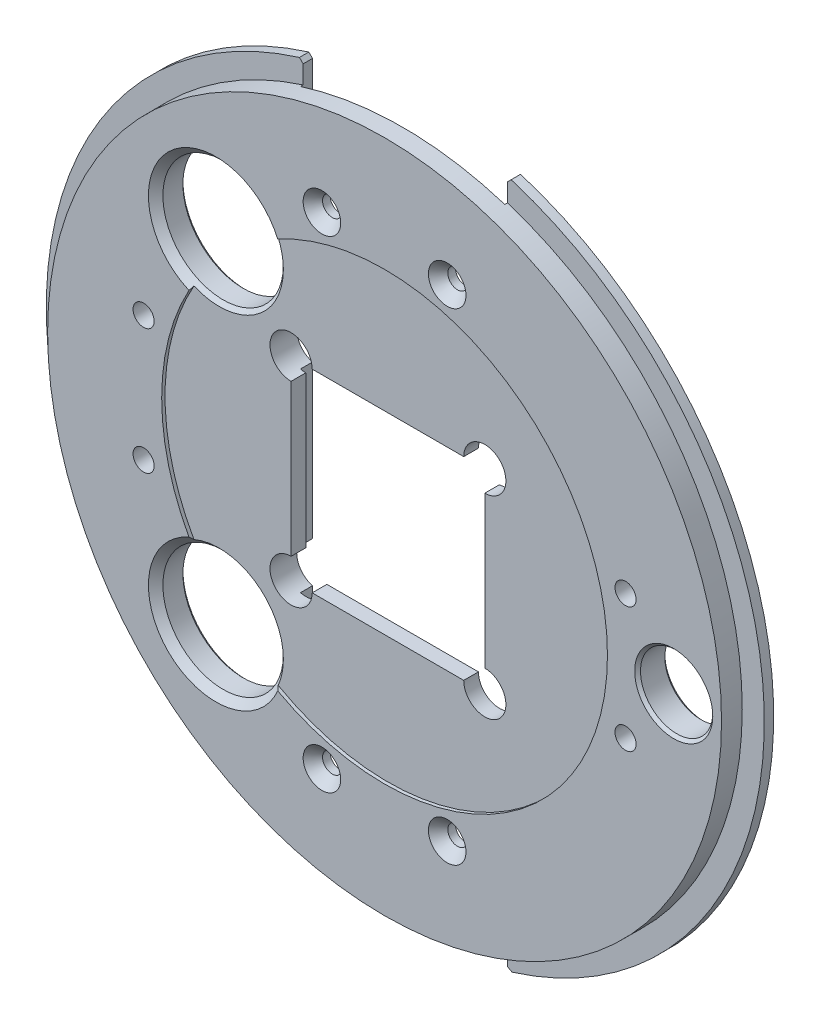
ISO-10303-21;
HEADER;
FILE_DESCRIPTION(('STEP AP214'),'2;1');
FILE_NAME('part.step','',(''),(''),'','','');
FILE_SCHEMA(('AUTOMOTIVE_DESIGN { 1 0 10303 214 1 1 1 1 }'));
ENDSEC;
DATA;
#1=APPLICATION_CONTEXT('core data for automotive mechanical design processes');
#2=APPLICATION_PROTOCOL_DEFINITION('international standard','automotive_design',2000,#1);
#3=PRODUCT_CONTEXT('',#1,'mechanical');
#4=PRODUCT('Part','Part','',(#3));
#5=PRODUCT_RELATED_PRODUCT_CATEGORY('part','',(#4));
#6=PRODUCT_DEFINITION_FORMATION('','',#4);
#7=PRODUCT_DEFINITION_CONTEXT('part definition',#1,'design');
#8=PRODUCT_DEFINITION('design','',#6,#7);
#9=PRODUCT_DEFINITION_SHAPE('','',#8);
#10=(LENGTH_UNIT() NAMED_UNIT(*) SI_UNIT(.MILLI.,.METRE.));
#11=(NAMED_UNIT(*) PLANE_ANGLE_UNIT() SI_UNIT($,.RADIAN.));
#12=(NAMED_UNIT(*) SI_UNIT($,.STERADIAN.) SOLID_ANGLE_UNIT());
#13=UNCERTAINTY_MEASURE_WITH_UNIT(LENGTH_MEASURE(1.E-05),#10,'distance_accuracy_value','');
#14=(GEOMETRIC_REPRESENTATION_CONTEXT(3) GLOBAL_UNCERTAINTY_ASSIGNED_CONTEXT((#13)) GLOBAL_UNIT_ASSIGNED_CONTEXT((#10,
#11,#12)) REPRESENTATION_CONTEXT('',''));
#15=CARTESIAN_POINT('',(0.,0.,0.));
#16=DIRECTION('',(0.,0.,1.));
#17=DIRECTION('',(1.,0.,0.));
#18=AXIS2_PLACEMENT_3D('',#15,#16,#17);
#19=CARTESIAN_POINT('',(0.,0.,-15.875));
#20=DIRECTION('',(0.,0.,1.));
#21=DIRECTION('',(1.,0.,0.));
#22=AXIS2_PLACEMENT_3D('',#19,#20,#21);
#23=CYLINDRICAL_SURFACE('',#22,189.23);
#24=CARTESIAN_POINT('',(0.,0.,-15.875));
#25=DIRECTION('',(0.,0.,1.));
#26=DIRECTION('',(1.,0.,0.));
#27=AXIS2_PLACEMENT_3D('',#24,#25,#26);
#28=CIRCLE('',#27,189.23);
#29=CARTESIAN_POINT('',(56.2620747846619,-180.672554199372,-15.875));
#30=VERTEX_POINT('',#29);
#31=CARTESIAN_POINT('',(55.79779310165,180.816479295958,-15.875));
#32=VERTEX_POINT('',#31);
#33=EDGE_CURVE('E1719',#30,#32,#28,.T.);
#34=ORIENTED_EDGE('',*,*,#33,.T.);
#35=DIRECTION('',(0.,0.,1.));
#36=VECTOR('',#35,1.);
#37=CARTESIAN_POINT('',(55.79779310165,180.816479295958,-15.875));
#38=LINE('',#37,#36);
#39=CARTESIAN_POINT('',(55.79779310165,180.816479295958,-10.922));
#40=VERTEX_POINT('',#39);
#41=EDGE_CURVE('E1760',#32,#40,#38,.T.);
#42=ORIENTED_EDGE('',*,*,#41,.T.);
#43=CARTESIAN_POINT('',(0.,0.,-10.922));
#44=DIRECTION('',(0.,0.,1.));
#45=DIRECTION('',(1.,0.,0.));
#46=AXIS2_PLACEMENT_3D('',#43,#44,#45);
#47=CIRCLE('',#46,189.23);
#48=CARTESIAN_POINT('',(56.2620747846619,-180.672554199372,-10.922));
#49=VERTEX_POINT('',#48);
#50=EDGE_CURVE('E1737',#40,#49,#47,.F.);
#51=ORIENTED_EDGE('',*,*,#50,.T.);
#52=DIRECTION('',(0.,0.,1.));
#53=VECTOR('',#52,1.);
#54=CARTESIAN_POINT('',(56.2620747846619,-180.672554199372,-15.875));
#55=LINE('',#54,#53);
#56=EDGE_CURVE('E1758',#49,#30,#55,.F.);
#57=ORIENTED_EDGE('',*,*,#56,.T.);
#58=EDGE_LOOP('',(#34,#42,#51,#57));
#59=FACE_BOUND('',#58,.T.);
#60=ADVANCED_FACE('F1394',(#59),#23,.T.);
#61=CARTESIAN_POINT('',(-51.054,-51.054,-15.875));
#62=DIRECTION('',(0.,-1.,0.));
#63=DIRECTION('',(0.,0.,-1.));
#64=AXIS2_PLACEMENT_3D('',#61,#62,#63);
#65=PLANE('',#64);
#66=DIRECTION('',(1.,0.,0.));
#67=VECTOR('',#66,1.);
#68=CARTESIAN_POINT('',(-51.054,-51.054,-9.525));
#69=LINE('',#68,#67);
#70=CARTESIAN_POINT('',(-39.9415,-51.054,-9.525));
#71=VERTEX_POINT('',#70);
#72=CARTESIAN_POINT('',(39.9415,-51.054,-9.525));
#73=VERTEX_POINT('',#72);
#74=EDGE_CURVE('E2009',#71,#73,#69,.T.);
#75=ORIENTED_EDGE('',*,*,#74,.F.);
#76=DIRECTION('',(0.,0.,1.));
#77=VECTOR('',#76,1.);
#78=CARTESIAN_POINT('',(-39.9415,-51.054,-15.875));
#79=LINE('',#78,#77);
#80=CARTESIAN_POINT('',(-39.9415,-51.054,-1.778));
#81=VERTEX_POINT('',#80);
#82=EDGE_CURVE('E1723',#81,#71,#79,.F.);
#83=ORIENTED_EDGE('',*,*,#82,.F.);
#84=DIRECTION('',(-1.,0.,0.));
#85=VECTOR('',#84,1.);
#86=CARTESIAN_POINT('',(-51.054,-51.054,-1.778));
#87=LINE('',#86,#85);
#88=CARTESIAN_POINT('',(39.9415,-51.054,-1.778));
#89=VERTEX_POINT('',#88);
#90=EDGE_CURVE('E1648',#89,#81,#87,.T.);
#91=ORIENTED_EDGE('',*,*,#90,.F.);
#92=DIRECTION('',(0.,0.,1.));
#93=VECTOR('',#92,1.);
#94=CARTESIAN_POINT('',(39.9415,-51.054,-15.875));
#95=LINE('',#94,#93);
#96=EDGE_CURVE('E1698',#73,#89,#95,.T.);
#97=ORIENTED_EDGE('',*,*,#96,.F.);
#98=EDGE_LOOP('',(#75,#83,#91,#97));
#99=FACE_BOUND('',#98,.T.);
#100=ADVANCED_FACE('F1911',(#99),#65,.F.);
#101=CARTESIAN_POINT('',(-51.054,51.054,-15.875));
#102=DIRECTION('',(-1.,0.,0.));
#103=DIRECTION('',(0.,-1.,0.));
#104=AXIS2_PLACEMENT_3D('',#101,#102,#103);
#105=PLANE('',#104);
#106=DIRECTION('',(0.,-1.,0.));
#107=VECTOR('',#106,1.);
#108=CARTESIAN_POINT('',(-51.054,51.054,-9.525));
#109=LINE('',#108,#107);
#110=CARTESIAN_POINT('',(-51.054,39.9415,-9.525));
#111=VERTEX_POINT('',#110);
#112=CARTESIAN_POINT('',(-51.054,-39.9415,-9.525));
#113=VERTEX_POINT('',#112);
#114=EDGE_CURVE('E2004',#111,#113,#109,.T.);
#115=ORIENTED_EDGE('',*,*,#114,.F.);
#116=DIRECTION('',(0.,0.,1.));
#117=VECTOR('',#116,1.);
#118=CARTESIAN_POINT('',(-51.054,39.9415,-15.875));
#119=LINE('',#118,#117);
#120=CARTESIAN_POINT('',(-51.054,39.9415,-1.778));
#121=VERTEX_POINT('',#120);
#122=EDGE_CURVE('E1700',#121,#111,#119,.F.);
#123=ORIENTED_EDGE('',*,*,#122,.F.);
#124=DIRECTION('',(0.,1.,0.));
#125=VECTOR('',#124,1.);
#126=CARTESIAN_POINT('',(-51.054,51.054,-1.778));
#127=LINE('',#126,#125);
#128=CARTESIAN_POINT('',(-51.054,-39.9415,-1.778));
#129=VERTEX_POINT('',#128);
#130=EDGE_CURVE('E1640',#129,#121,#127,.T.);
#131=ORIENTED_EDGE('',*,*,#130,.F.);
#132=DIRECTION('',(0.,0.,1.));
#133=VECTOR('',#132,1.);
#134=CARTESIAN_POINT('',(-51.054,-39.9415,-15.875));
#135=LINE('',#134,#133);
#136=EDGE_CURVE('E1726',#113,#129,#135,.T.);
#137=ORIENTED_EDGE('',*,*,#136,.F.);
#138=EDGE_LOOP('',(#115,#123,#131,#137));
#139=FACE_BOUND('',#138,.T.);
#140=ADVANCED_FACE('F1918',(#139),#105,.F.);
#141=CARTESIAN_POINT('',(51.054,51.054,-15.875));
#142=DIRECTION('',(1.,0.,0.));
#143=DIRECTION('',(0.,1.,0.));
#144=AXIS2_PLACEMENT_3D('',#141,#142,#143);
#145=PLANE('',#144);
#146=DIRECTION('',(0.,1.,0.));
#147=VECTOR('',#146,1.);
#148=CARTESIAN_POINT('',(51.054,51.054,-9.525));
#149=LINE('',#148,#147);
#150=CARTESIAN_POINT('',(51.054,-39.9415,-9.525));
#151=VERTEX_POINT('',#150);
#152=CARTESIAN_POINT('',(51.054,39.9415,-9.525));
#153=VERTEX_POINT('',#152);
#154=EDGE_CURVE('E1998',#151,#153,#149,.T.);
#155=ORIENTED_EDGE('',*,*,#154,.F.);
#156=DIRECTION('',(0.,0.,1.));
#157=VECTOR('',#156,1.);
#158=CARTESIAN_POINT('',(51.054,-39.9415,-15.875));
#159=LINE('',#158,#157);
#160=CARTESIAN_POINT('',(51.054,-39.9415,-1.778));
#161=VERTEX_POINT('',#160);
#162=EDGE_CURVE('E1728',#161,#151,#159,.F.);
#163=ORIENTED_EDGE('',*,*,#162,.F.);
#164=DIRECTION('',(0.,-1.,0.));
#165=VECTOR('',#164,1.);
#166=CARTESIAN_POINT('',(51.054,51.054,-1.778));
#167=LINE('',#166,#165);
#168=CARTESIAN_POINT('',(51.054,39.9415,-1.778));
#169=VERTEX_POINT('',#168);
#170=EDGE_CURVE('E1638',#169,#161,#167,.T.);
#171=ORIENTED_EDGE('',*,*,#170,.F.);
#172=DIRECTION('',(0.,0.,1.));
#173=VECTOR('',#172,1.);
#174=CARTESIAN_POINT('',(51.054,39.9415,-15.875));
#175=LINE('',#174,#173);
#176=EDGE_CURVE('E1703',#153,#169,#175,.T.);
#177=ORIENTED_EDGE('',*,*,#176,.F.);
#178=EDGE_LOOP('',(#155,#163,#171,#177));
#179=FACE_BOUND('',#178,.T.);
#180=ADVANCED_FACE('F2080',(#179),#145,.F.);
#181=CARTESIAN_POINT('',(-51.054,51.054,-15.875));
#182=DIRECTION('',(0.,1.,0.));
#183=DIRECTION('',(0.,0.,1.));
#184=AXIS2_PLACEMENT_3D('',#181,#182,#183);
#185=PLANE('',#184);
#186=DIRECTION('',(-1.,0.,0.));
#187=VECTOR('',#186,1.);
#188=CARTESIAN_POINT('',(-51.054,51.054,-9.525));
#189=LINE('',#188,#187);
#190=CARTESIAN_POINT('',(39.9415,51.054,-9.525));
#191=VERTEX_POINT('',#190);
#192=CARTESIAN_POINT('',(-39.9415,51.054,-9.525));
#193=VERTEX_POINT('',#192);
#194=EDGE_CURVE('E1991',#191,#193,#189,.T.);
#195=ORIENTED_EDGE('',*,*,#194,.F.);
#196=DIRECTION('',(0.,0.,1.));
#197=VECTOR('',#196,1.);
#198=CARTESIAN_POINT('',(39.9415,51.054,-15.875));
#199=LINE('',#198,#197);
#200=CARTESIAN_POINT('',(39.9415,51.054,-1.778));
#201=VERTEX_POINT('',#200);
#202=EDGE_CURVE('E1731',#201,#191,#199,.F.);
#203=ORIENTED_EDGE('',*,*,#202,.F.);
#204=DIRECTION('',(1.,0.,0.));
#205=VECTOR('',#204,1.);
#206=CARTESIAN_POINT('',(-51.054,51.054,-1.778));
#207=LINE('',#206,#205);
#208=CARTESIAN_POINT('',(-39.9415,51.054,-1.778));
#209=VERTEX_POINT('',#208);
#210=EDGE_CURVE('E1630',#209,#201,#207,.T.);
#211=ORIENTED_EDGE('',*,*,#210,.F.);
#212=DIRECTION('',(0.,0.,1.));
#213=VECTOR('',#212,1.);
#214=CARTESIAN_POINT('',(-39.9415,51.054,-15.875));
#215=LINE('',#214,#213);
#216=EDGE_CURVE('E1705',#193,#209,#215,.T.);
#217=ORIENTED_EDGE('',*,*,#216,.F.);
#218=EDGE_LOOP('',(#195,#203,#211,#217));
#219=FACE_BOUND('',#218,.T.);
#220=ADVANCED_FACE('F2091',(#219),#185,.F.);
#221=CARTESIAN_POINT('',(0.,0.,-15.875));
#222=DIRECTION('',(0.,0.,1.));
#223=DIRECTION('',(1.,0.,0.));
#224=AXIS2_PLACEMENT_3D('',#221,#222,#223);
#225=PLANE('',#224);
#226=CARTESIAN_POINT('',(152.4,0.,-15.875));
#227=DIRECTION('',(0.,0.,1.));
#228=DIRECTION('',(1.,0.,0.));
#229=AXIS2_PLACEMENT_3D('',#226,#227,#228);
#230=CIRCLE('',#229,20.574);
#231=CARTESIAN_POINT('',(172.974,0.,-15.875));
#232=VERTEX_POINT('',#231);
#233=EDGE_CURVE('E1799',#232,#232,#230,.T.);
#234=ORIENTED_EDGE('',*,*,#233,.T.);
#235=EDGE_LOOP('',(#234));
#236=FACE_BOUND('',#235,.T.);
#237=CARTESIAN_POINT('',(127.,-33.02,-15.875));
#238=DIRECTION('',(0.,0.,1.));
#239=DIRECTION('',(1.,0.,0.));
#240=AXIS2_PLACEMENT_3D('',#237,#238,#239);
#241=CIRCLE('',#240,5.55625);
#242=CARTESIAN_POINT('',(132.55625,-33.02,-15.875));
#243=VERTEX_POINT('',#242);
#244=EDGE_CURVE('E1689',#243,#243,#241,.T.);
#245=ORIENTED_EDGE('',*,*,#244,.T.);
#246=EDGE_LOOP('',(#245));
#247=FACE_BOUND('',#246,.T.);
#248=CARTESIAN_POINT('',(127.,33.02,-15.875));
#249=DIRECTION('',(0.,0.,1.));
#250=DIRECTION('',(1.,0.,0.));
#251=AXIS2_PLACEMENT_3D('',#248,#249,#250);
#252=CIRCLE('',#251,5.55625);
#253=CARTESIAN_POINT('',(132.55625,33.02,-15.875));
#254=VERTEX_POINT('',#253);
#255=EDGE_CURVE('E1683',#254,#254,#252,.T.);
#256=ORIENTED_EDGE('',*,*,#255,.T.);
#257=EDGE_LOOP('',(#256));
#258=FACE_BOUND('',#257,.T.);
#259=DIRECTION('',(0.,-1.,0.));
#260=VECTOR('',#259,1.);
#261=CARTESIAN_POINT('',(53.848,214.075076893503,-15.875));
#262=LINE('',#261,#260);
#263=CARTESIAN_POINT('',(53.848,178.866686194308,-15.875));
#264=VERTEX_POINT('',#263);
#265=CARTESIAN_POINT('',(53.848,61.8095204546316,-15.875));
#266=VERTEX_POINT('',#265);
#267=EDGE_CURVE('E1950',#264,#266,#262,.T.);
#268=ORIENTED_EDGE('',*,*,#267,.F.);
#269=DIRECTION('',(0.707106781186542,0.707106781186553,0.));
#270=VECTOR('',#269,1.);
#271=CARTESIAN_POINT('',(53.848,178.866686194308,-15.875));
#272=LINE('',#271,#270);
#273=EDGE_CURVE('E1756',#264,#32,#272,.T.);
#274=ORIENTED_EDGE('',*,*,#273,.T.);
#275=ORIENTED_EDGE('',*,*,#33,.F.);
#276=DIRECTION('',(0.879089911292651,-0.476655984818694,0.));
#277=VECTOR('',#276,1.);
#278=CARTESIAN_POINT('',(53.848,-179.363605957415,-15.875));
#279=LINE('',#278,#277);
#280=CARTESIAN_POINT('',(53.848,-179.363605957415,-15.875));
#281=VERTEX_POINT('',#280);
#282=EDGE_CURVE('E1754',#30,#281,#279,.F.);
#283=ORIENTED_EDGE('',*,*,#282,.T.);
#284=CARTESIAN_POINT('',(53.848,-61.8095204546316,-15.875));
#285=VERTEX_POINT('',#284);
#286=EDGE_CURVE('E1822',#285,#281,#262,.T.);
#287=ORIENTED_EDGE('',*,*,#286,.F.);
#288=CARTESIAN_POINT('',(51.054,-51.054,-15.875));
#289=DIRECTION('',(0.,0.,1.));
#290=DIRECTION('',(1.,0.,0.));
#291=AXIS2_PLACEMENT_3D('',#288,#289,#290);
#292=CIRCLE('',#291,11.1125);
#293=CARTESIAN_POINT('',(53.848,-40.2984795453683,-15.875));
#294=VERTEX_POINT('',#293);
#295=EDGE_CURVE('E1710',#285,#294,#292,.T.);
#296=ORIENTED_EDGE('',*,*,#295,.T.);
#297=CARTESIAN_POINT('',(53.848,40.2984795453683,-15.875));
#298=VERTEX_POINT('',#297);
#299=EDGE_CURVE('E1953',#298,#294,#262,.T.);
#300=ORIENTED_EDGE('',*,*,#299,.F.);
#301=CARTESIAN_POINT('',(51.054,51.054,-15.875));
#302=DIRECTION('',(0.,0.,1.));
#303=DIRECTION('',(1.,0.,0.));
#304=AXIS2_PLACEMENT_3D('',#301,#302,#303);
#305=CIRCLE('',#304,11.1125);
#306=EDGE_CURVE('E1713',#298,#266,#305,.T.);
#307=ORIENTED_EDGE('',*,*,#306,.T.);
#308=EDGE_LOOP('',(#268,#274,#275,#283,#287,#296,#300,#307));
#309=FACE_BOUND('',#308,.T.);
#310=ADVANCED_FACE('F2062',(#236,#247,#258,#309),#225,.F.);
#311=CARTESIAN_POINT('',(-33.02,-127.,-15.875));
#312=DIRECTION('',(0.,0.,1.));
#313=DIRECTION('',(1.,0.,0.));
#314=AXIS2_PLACEMENT_3D('',#311,#312,#313);
#315=CYLINDRICAL_SURFACE('',#314,5.1562);
#316=CARTESIAN_POINT('',(-33.02,-127.,-5.46401986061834));
#317=DIRECTION('',(0.,0.,1.));
#318=DIRECTION('',(1.,0.,0.));
#319=AXIS2_PLACEMENT_3D('',#316,#317,#318);
#320=CIRCLE('',#319,5.1562);
#321=CARTESIAN_POINT('',(-27.8638,-127.,-5.46401986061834));
#322=VERTEX_POINT('',#321);
#323=EDGE_CURVE('E1651',#322,#322,#320,.F.);
#324=ORIENTED_EDGE('',*,*,#323,.F.);
#325=EDGE_LOOP('',(#324));
#326=FACE_BOUND('',#325,.T.);
#327=CARTESIAN_POINT('',(-33.02,-127.,-9.525));
#328=DIRECTION('',(0.,0.,-1.));
#329=DIRECTION('',(-1.,0.,0.));
#330=AXIS2_PLACEMENT_3D('',#327,#328,#329);
#331=CIRCLE('',#330,5.1562);
#332=CARTESIAN_POINT('',(-38.1762,-127.,-9.525));
#333=VERTEX_POINT('',#332);
#334=EDGE_CURVE('E1988',#333,#333,#331,.F.);
#335=ORIENTED_EDGE('',*,*,#334,.F.);
#336=EDGE_LOOP('',(#335));
#337=FACE_BOUND('',#336,.T.);
#338=ADVANCED_FACE('F2145',(#326,#337),#315,.F.);
#339=CARTESIAN_POINT('',(33.02,-127.,-15.875));
#340=DIRECTION('',(0.,0.,1.));
#341=DIRECTION('',(1.,0.,0.));
#342=AXIS2_PLACEMENT_3D('',#339,#340,#341);
#343=CYLINDRICAL_SURFACE('',#342,5.1562);
#344=CARTESIAN_POINT('',(33.02,-127.,-5.46401986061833));
#345=DIRECTION('',(0.,0.,1.));
#346=DIRECTION('',(1.,0.,0.));
#347=AXIS2_PLACEMENT_3D('',#344,#345,#346);
#348=CIRCLE('',#347,5.1562);
#349=CARTESIAN_POINT('',(38.1762,-127.,-5.46401986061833));
#350=VERTEX_POINT('',#349);
#351=EDGE_CURVE('E1657',#350,#350,#348,.F.);
#352=ORIENTED_EDGE('',*,*,#351,.F.);
#353=EDGE_LOOP('',(#352));
#354=FACE_BOUND('',#353,.T.);
#355=CARTESIAN_POINT('',(33.02,-127.,-9.525));
#356=DIRECTION('',(0.,0.,-1.));
#357=DIRECTION('',(-1.,0.,0.));
#358=AXIS2_PLACEMENT_3D('',#355,#356,#357);
#359=CIRCLE('',#358,5.1562);
#360=CARTESIAN_POINT('',(27.8638,-127.,-9.525));
#361=VERTEX_POINT('',#360);
#362=EDGE_CURVE('E1983',#361,#361,#359,.F.);
#363=ORIENTED_EDGE('',*,*,#362,.F.);
#364=EDGE_LOOP('',(#363));
#365=FACE_BOUND('',#364,.T.);
#366=ADVANCED_FACE('F2136',(#354,#365),#343,.F.);
#367=CARTESIAN_POINT('',(33.02,127.,-15.875));
#368=DIRECTION('',(0.,0.,1.));
#369=DIRECTION('',(1.,0.,0.));
#370=AXIS2_PLACEMENT_3D('',#367,#368,#369);
#371=CYLINDRICAL_SURFACE('',#370,5.1562);
#372=CARTESIAN_POINT('',(33.02,127.,-5.46401986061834));
#373=DIRECTION('',(0.,0.,1.));
#374=DIRECTION('',(1.,0.,0.));
#375=AXIS2_PLACEMENT_3D('',#372,#373,#374);
#376=CIRCLE('',#375,5.1562);
#377=CARTESIAN_POINT('',(38.1762,127.,-5.46401986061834));
#378=VERTEX_POINT('',#377);
#379=EDGE_CURVE('E1663',#378,#378,#376,.F.);
#380=ORIENTED_EDGE('',*,*,#379,.F.);
#381=EDGE_LOOP('',(#380));
#382=FACE_BOUND('',#381,.T.);
#383=CARTESIAN_POINT('',(33.02,127.,-9.525));
#384=DIRECTION('',(0.,0.,-1.));
#385=DIRECTION('',(-1.,0.,0.));
#386=AXIS2_PLACEMENT_3D('',#383,#384,#385);
#387=CIRCLE('',#386,5.1562);
#388=CARTESIAN_POINT('',(27.8638,127.,-9.525));
#389=VERTEX_POINT('',#388);
#390=EDGE_CURVE('E1979',#389,#389,#387,.F.);
#391=ORIENTED_EDGE('',*,*,#390,.F.);
#392=EDGE_LOOP('',(#391));
#393=FACE_BOUND('',#392,.T.);
#394=ADVANCED_FACE('F2134',(#382,#393),#371,.F.);
#395=CARTESIAN_POINT('',(-33.02,127.,-15.875));
#396=DIRECTION('',(0.,0.,1.));
#397=DIRECTION('',(1.,0.,0.));
#398=AXIS2_PLACEMENT_3D('',#395,#396,#397);
#399=CYLINDRICAL_SURFACE('',#398,5.1562);
#400=CARTESIAN_POINT('',(-33.02,127.,-5.46401986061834));
#401=DIRECTION('',(0.,0.,1.));
#402=DIRECTION('',(1.,0.,0.));
#403=AXIS2_PLACEMENT_3D('',#400,#401,#402);
#404=CIRCLE('',#403,5.1562);
#405=CARTESIAN_POINT('',(-27.8638,127.,-5.46401986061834));
#406=VERTEX_POINT('',#405);
#407=EDGE_CURVE('E1669',#406,#406,#404,.F.);
#408=ORIENTED_EDGE('',*,*,#407,.F.);
#409=EDGE_LOOP('',(#408));
#410=FACE_BOUND('',#409,.T.);
#411=CARTESIAN_POINT('',(-33.02,127.,-9.525));
#412=DIRECTION('',(0.,0.,-1.));
#413=DIRECTION('',(-1.,0.,0.));
#414=AXIS2_PLACEMENT_3D('',#411,#412,#413);
#415=CIRCLE('',#414,5.1562);
#416=CARTESIAN_POINT('',(-38.1762,127.,-9.525));
#417=VERTEX_POINT('',#416);
#418=EDGE_CURVE('E1975',#417,#417,#415,.F.);
#419=ORIENTED_EDGE('',*,*,#418,.F.);
#420=EDGE_LOOP('',(#419));
#421=FACE_BOUND('',#420,.T.);
#422=ADVANCED_FACE('F1929',(#410,#421),#399,.F.);
#423=CARTESIAN_POINT('',(0.,0.,-10.922));
#424=DIRECTION('',(0.,0.,1.));
#425=DIRECTION('',(1.,0.,0.));
#426=AXIS2_PLACEMENT_3D('',#423,#424,#425);
#427=PLANE('',#426);
#428=ORIENTED_EDGE('',*,*,#50,.F.);
#429=DIRECTION('',(-0.707106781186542,-0.707106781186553,0.));
#430=VECTOR('',#429,1.);
#431=CARTESIAN_POINT('',(-62.5093430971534,62.5093430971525,-10.922));
#432=LINE('',#431,#430);
#433=CARTESIAN_POINT('',(53.848,178.866686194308,-10.922));
#434=VERTEX_POINT('',#433);
#435=EDGE_CURVE('E1764',#40,#434,#432,.T.);
#436=ORIENTED_EDGE('',*,*,#435,.T.);
#437=DIRECTION('',(0.,1.,0.));
#438=VECTOR('',#437,1.);
#439=CARTESIAN_POINT('',(53.848,0.,-10.922));
#440=LINE('',#439,#438);
#441=CARTESIAN_POINT('',(53.848,169.236568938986,-10.922));
#442=VERTEX_POINT('',#441);
#443=EDGE_CURVE('E2025',#442,#434,#440,.T.);
#444=ORIENTED_EDGE('',*,*,#443,.F.);
#445=CARTESIAN_POINT('',(0.,0.,-10.922));
#446=DIRECTION('',(0.,0.,1.));
#447=DIRECTION('',(1.,0.,0.));
#448=AXIS2_PLACEMENT_3D('',#445,#446,#447);
#449=CIRCLE('',#448,177.5968);
#450=CARTESIAN_POINT('',(53.848,-169.236568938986,-10.922));
#451=VERTEX_POINT('',#450);
#452=EDGE_CURVE('E1627',#451,#442,#449,.T.);
#453=ORIENTED_EDGE('',*,*,#452,.F.);
#454=CARTESIAN_POINT('',(53.848,-179.363605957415,-10.922));
#455=VERTEX_POINT('',#454);
#456=EDGE_CURVE('E2023',#455,#451,#440,.T.);
#457=ORIENTED_EDGE('',*,*,#456,.F.);
#458=DIRECTION('',(-0.879089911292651,0.476655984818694,0.));
#459=VECTOR('',#458,1.);
#460=CARTESIAN_POINT('',(-62.9232445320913,-116.048452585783,-10.922));
#461=LINE('',#460,#459);
#462=EDGE_CURVE('E1762',#455,#49,#461,.F.);
#463=ORIENTED_EDGE('',*,*,#462,.T.);
#464=EDGE_LOOP('',(#428,#436,#444,#453,#457,#463));
#465=FACE_BOUND('',#464,.T.);
#466=ADVANCED_FACE('F1904',(#465),#427,.T.);
#467=CARTESIAN_POINT('',(-55.79779310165,-180.816479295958,-10.922));
#468=VERTEX_POINT('',#467);
#469=CARTESIAN_POINT('',(-55.79779310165,180.816479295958,-10.922));
#470=VERTEX_POINT('',#469);
#471=EDGE_CURVE('E1625',#468,#470,#47,.F.);
#472=ORIENTED_EDGE('',*,*,#471,.T.);
#473=DIRECTION('',(0.,0.,1.));
#474=VECTOR('',#473,1.);
#475=CARTESIAN_POINT('',(-55.79779310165,180.816479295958,-15.875));
#476=LINE('',#475,#474);
#477=CARTESIAN_POINT('',(-55.79779310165,180.816479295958,-15.875));
#478=VERTEX_POINT('',#477);
#479=EDGE_CURVE('E1775',#470,#478,#476,.F.);
#480=ORIENTED_EDGE('',*,*,#479,.T.);
#481=CARTESIAN_POINT('',(-55.79779310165,-180.816479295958,-15.875));
#482=VERTEX_POINT('',#481);
#483=EDGE_CURVE('E1720',#478,#482,#28,.T.);
#484=ORIENTED_EDGE('',*,*,#483,.T.);
#485=DIRECTION('',(0.,0.,1.));
#486=VECTOR('',#485,1.);
#487=CARTESIAN_POINT('',(-55.79779310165,-180.816479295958,-15.875));
#488=LINE('',#487,#486);
#489=EDGE_CURVE('E1773',#482,#468,#488,.T.);
#490=ORIENTED_EDGE('',*,*,#489,.T.);
#491=EDGE_LOOP('',(#472,#480,#484,#490));
#492=FACE_BOUND('',#491,.T.);
#493=ADVANCED_FACE('F1396',(#492),#23,.T.);
#494=CARTESIAN_POINT('',(0.,0.,0.));
#495=DIRECTION('',(0.,0.,1.));
#496=DIRECTION('',(1.,0.,0.));
#497=AXIS2_PLACEMENT_3D('',#494,#495,#496);
#498=PLANE('',#497);
#499=CARTESIAN_POINT('',(-88.9,-88.9,0.));
#500=DIRECTION('',(0.,0.,1.));
#501=DIRECTION('',(1.,0.,0.));
#502=AXIS2_PLACEMENT_3D('',#499,#500,#501);
#503=CIRCLE('',#502,35.56);
#504=CARTESIAN_POINT('',(-103.104982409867,-56.3004283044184,0.));
#505=VERTEX_POINT('',#504);
#506=CARTESIAN_POINT('',(-56.3004283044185,-103.104982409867,0.));
#507=VERTEX_POINT('',#506);
#508=EDGE_CURVE('E1605',#505,#507,#503,.T.);
#509=ORIENTED_EDGE('',*,*,#508,.F.);
#510=CARTESIAN_POINT('',(0.,0.,0.));
#511=DIRECTION('',(0.,0.,1.));
#512=DIRECTION('',(1.,0.,0.));
#513=AXIS2_PLACEMENT_3D('',#510,#511,#512);
#514=CIRCLE('',#513,117.475);
#515=CARTESIAN_POINT('',(-103.104982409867,56.3004283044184,0.));
#516=VERTEX_POINT('',#515);
#517=EDGE_CURVE('E1617',#516,#505,#514,.T.);
#518=ORIENTED_EDGE('',*,*,#517,.F.);
#519=CARTESIAN_POINT('',(-88.9,88.9,0.));
#520=DIRECTION('',(0.,0.,1.));
#521=DIRECTION('',(1.,0.,0.));
#522=AXIS2_PLACEMENT_3D('',#519,#520,#521);
#523=CIRCLE('',#522,35.56);
#524=CARTESIAN_POINT('',(-56.3004283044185,103.104982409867,0.));
#525=VERTEX_POINT('',#524);
#526=EDGE_CURVE('E1824',#525,#516,#523,.T.);
#527=ORIENTED_EDGE('',*,*,#526,.F.);
#528=EDGE_CURVE('E1618',#507,#525,#514,.T.);
#529=ORIENTED_EDGE('',*,*,#528,.F.);
#530=EDGE_LOOP('',(#509,#518,#527,#529));
#531=FACE_BOUND('',#530,.T.);
#532=CARTESIAN_POINT('',(152.4,0.,0.));
#533=DIRECTION('',(0.,0.,1.));
#534=DIRECTION('',(1.,0.,0.));
#535=AXIS2_PLACEMENT_3D('',#532,#533,#534);
#536=CIRCLE('',#535,20.574);
#537=CARTESIAN_POINT('',(172.974,0.,0.));
#538=VERTEX_POINT('',#537);
#539=EDGE_CURVE('E1808',#538,#538,#536,.F.);
#540=ORIENTED_EDGE('',*,*,#539,.T.);
#541=EDGE_LOOP('',(#540));
#542=FACE_BOUND('',#541,.T.);
#543=CARTESIAN_POINT('',(-127.,-33.02,0.));
#544=DIRECTION('',(0.,0.,1.));
#545=DIRECTION('',(1.,0.,0.));
#546=AXIS2_PLACEMENT_3D('',#543,#544,#545);
#547=CIRCLE('',#546,5.55625);
#548=CARTESIAN_POINT('',(-121.44375,-33.02,0.));
#549=VERTEX_POINT('',#548);
#550=EDGE_CURVE('E1692',#549,#549,#547,.T.);
#551=ORIENTED_EDGE('',*,*,#550,.F.);
#552=EDGE_LOOP('',(#551));
#553=FACE_BOUND('',#552,.T.);
#554=CARTESIAN_POINT('',(127.,-33.02,0.));
#555=DIRECTION('',(0.,0.,1.));
#556=DIRECTION('',(1.,0.,0.));
#557=AXIS2_PLACEMENT_3D('',#554,#555,#556);
#558=CIRCLE('',#557,5.55625);
#559=CARTESIAN_POINT('',(132.55625,-33.02,0.));
#560=VERTEX_POINT('',#559);
#561=EDGE_CURVE('E1686',#560,#560,#558,.T.);
#562=ORIENTED_EDGE('',*,*,#561,.F.);
#563=EDGE_LOOP('',(#562));
#564=FACE_BOUND('',#563,.T.);
#565=CARTESIAN_POINT('',(127.,33.02,0.));
#566=DIRECTION('',(0.,0.,1.));
#567=DIRECTION('',(1.,0.,0.));
#568=AXIS2_PLACEMENT_3D('',#565,#566,#567);
#569=CIRCLE('',#568,5.55625);
#570=CARTESIAN_POINT('',(132.55625,33.02,0.));
#571=VERTEX_POINT('',#570);
#572=EDGE_CURVE('E1680',#571,#571,#569,.T.);
#573=ORIENTED_EDGE('',*,*,#572,.F.);
#574=EDGE_LOOP('',(#573));
#575=FACE_BOUND('',#574,.T.);
#576=CARTESIAN_POINT('',(-127.,33.02,0.));
#577=DIRECTION('',(0.,0.,1.));
#578=DIRECTION('',(1.,0.,0.));
#579=AXIS2_PLACEMENT_3D('',#576,#577,#578);
#580=CIRCLE('',#579,5.55625);
#581=CARTESIAN_POINT('',(-121.44375,33.02,0.));
#582=VERTEX_POINT('',#581);
#583=EDGE_CURVE('E1672',#582,#582,#580,.T.);
#584=ORIENTED_EDGE('',*,*,#583,.F.);
#585=EDGE_LOOP('',(#584));
#586=FACE_BOUND('',#585,.T.);
#587=CARTESIAN_POINT('',(-33.02,127.,0.));
#588=DIRECTION('',(0.,0.,1.));
#589=DIRECTION('',(1.,0.,0.));
#590=AXIS2_PLACEMENT_3D('',#587,#588,#589);
#591=CIRCLE('',#590,9.906);
#592=CARTESIAN_POINT('',(-23.114,127.,0.));
#593=VERTEX_POINT('',#592);
#594=EDGE_CURVE('E1666',#593,#593,#591,.T.);
#595=ORIENTED_EDGE('',*,*,#594,.F.);
#596=EDGE_LOOP('',(#595));
#597=FACE_BOUND('',#596,.T.);
#598=CARTESIAN_POINT('',(33.02,127.,0.));
#599=DIRECTION('',(0.,0.,1.));
#600=DIRECTION('',(1.,0.,0.));
#601=AXIS2_PLACEMENT_3D('',#598,#599,#600);
#602=CIRCLE('',#601,9.906);
#603=CARTESIAN_POINT('',(42.926,127.,0.));
#604=VERTEX_POINT('',#603);
#605=EDGE_CURVE('E1660',#604,#604,#602,.T.);
#606=ORIENTED_EDGE('',*,*,#605,.F.);
#607=EDGE_LOOP('',(#606));
#608=FACE_BOUND('',#607,.T.);
#609=CARTESIAN_POINT('',(33.02,-127.,0.));
#610=DIRECTION('',(0.,0.,1.));
#611=DIRECTION('',(1.,0.,0.));
#612=AXIS2_PLACEMENT_3D('',#609,#610,#611);
#613=CIRCLE('',#612,9.906);
#614=CARTESIAN_POINT('',(42.926,-127.,0.));
#615=VERTEX_POINT('',#614);
#616=EDGE_CURVE('E1654',#615,#615,#613,.T.);
#617=ORIENTED_EDGE('',*,*,#616,.F.);
#618=EDGE_LOOP('',(#617));
#619=FACE_BOUND('',#618,.T.);
#620=CARTESIAN_POINT('',(-33.02,-127.,0.));
#621=DIRECTION('',(0.,0.,1.));
#622=DIRECTION('',(1.,0.,0.));
#623=AXIS2_PLACEMENT_3D('',#620,#621,#622);
#624=CIRCLE('',#623,9.906);
#625=CARTESIAN_POINT('',(-23.114,-127.,0.));
#626=VERTEX_POINT('',#625);
#627=EDGE_CURVE('E1650',#626,#626,#624,.T.);
#628=ORIENTED_EDGE('',*,*,#627,.F.);
#629=EDGE_LOOP('',(#628));
#630=FACE_BOUND('',#629,.T.);
#631=CARTESIAN_POINT('',(0.,0.,0.));
#632=DIRECTION('',(0.,0.,1.));
#633=DIRECTION('',(1.,0.,0.));
#634=AXIS2_PLACEMENT_3D('',#631,#632,#633);
#635=CIRCLE('',#634,177.5968);
#636=CARTESIAN_POINT('',(177.5968,0.,0.));
#637=VERTEX_POINT('',#636);
#638=EDGE_CURVE('E2037',#637,#637,#635,.T.);
#639=ORIENTED_EDGE('',*,*,#638,.T.);
#640=EDGE_LOOP('',(#639));
#641=FACE_BOUND('',#640,.T.);
#642=ADVANCED_FACE('F1614',(#531,#542,#553,#564,#575,#586,#597,#608,#619,#630,#641),#498,.T.);
#643=CARTESIAN_POINT('',(-51.054,51.054,-15.875));
#644=DIRECTION('',(0.,0.,1.));
#645=DIRECTION('',(1.,0.,0.));
#646=AXIS2_PLACEMENT_3D('',#643,#644,#645);
#647=CYLINDRICAL_SURFACE('',#646,11.1125);
#648=CARTESIAN_POINT('',(-51.054,51.054,-9.525));
#649=DIRECTION('',(0.,0.,-1.));
#650=DIRECTION('',(-1.,0.,0.));
#651=AXIS2_PLACEMENT_3D('',#648,#649,#650);
#652=CIRCLE('',#651,11.1125);
#653=CARTESIAN_POINT('',(-53.848,40.2984795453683,-9.525));
#654=VERTEX_POINT('',#653);
#655=EDGE_CURVE('E1999',#654,#111,#652,.F.);
#656=ORIENTED_EDGE('',*,*,#655,.F.);
#657=DIRECTION('',(0.,0.,1.));
#658=VECTOR('',#657,1.);
#659=CARTESIAN_POINT('',(-53.848,40.2984795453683,-15.875));
#660=LINE('',#659,#658);
#661=CARTESIAN_POINT('',(-53.848,40.2984795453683,-15.875));
#662=VERTEX_POINT('',#661);
#663=EDGE_CURVE('E2020',#654,#662,#660,.F.);
#664=ORIENTED_EDGE('',*,*,#663,.T.);
#665=CARTESIAN_POINT('',(-51.054,51.054,-15.875));
#666=DIRECTION('',(0.,0.,1.));
#667=DIRECTION('',(1.,0.,0.));
#668=AXIS2_PLACEMENT_3D('',#665,#666,#667);
#669=CIRCLE('',#668,11.1125);
#670=CARTESIAN_POINT('',(-53.848,61.8095204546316,-15.875));
#671=VERTEX_POINT('',#670);
#672=EDGE_CURVE('E1716',#671,#662,#669,.T.);
#673=ORIENTED_EDGE('',*,*,#672,.F.);
#674=DIRECTION('',(0.,0.,1.));
#675=VECTOR('',#674,1.);
#676=CARTESIAN_POINT('',(-53.848,61.8095204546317,-15.875));
#677=LINE('',#676,#675);
#678=CARTESIAN_POINT('',(-53.848,61.8095204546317,-9.525));
#679=VERTEX_POINT('',#678);
#680=EDGE_CURVE('E1948',#671,#679,#677,.T.);
#681=ORIENTED_EDGE('',*,*,#680,.T.);
#682=EDGE_CURVE('E1995',#193,#679,#652,.F.);
#683=ORIENTED_EDGE('',*,*,#682,.F.);
#684=ORIENTED_EDGE('',*,*,#216,.T.);
#685=CARTESIAN_POINT('',(-51.054,51.054,-1.778));
#686=DIRECTION('',(0.,0.,1.));
#687=DIRECTION('',(1.,0.,0.));
#688=AXIS2_PLACEMENT_3D('',#685,#686,#687);
#689=CIRCLE('',#688,11.1125);
#690=EDGE_CURVE('E1635',#121,#209,#689,.F.);
#691=ORIENTED_EDGE('',*,*,#690,.F.);
#692=ORIENTED_EDGE('',*,*,#122,.T.);
#693=EDGE_LOOP('',(#656,#664,#673,#681,#683,#684,#691,#692));
#694=FACE_BOUND('',#693,.T.);
#695=ADVANCED_FACE('F1927',(#694),#647,.F.);
#696=CARTESIAN_POINT('',(51.054,51.054,-15.875));
#697=DIRECTION('',(0.,0.,1.));
#698=DIRECTION('',(1.,0.,0.));
#699=AXIS2_PLACEMENT_3D('',#696,#697,#698);
#700=CYLINDRICAL_SURFACE('',#699,11.1125);
#701=CARTESIAN_POINT('',(51.054,51.054,-9.525));
#702=DIRECTION('',(0.,0.,-1.));
#703=DIRECTION('',(-1.,0.,0.));
#704=AXIS2_PLACEMENT_3D('',#701,#702,#703);
#705=CIRCLE('',#704,11.1125);
#706=CARTESIAN_POINT('',(53.848,61.8095204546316,-9.525));
#707=VERTEX_POINT('',#706);
#708=EDGE_CURVE('E1993',#707,#191,#705,.F.);
#709=ORIENTED_EDGE('',*,*,#708,.F.);
#710=DIRECTION('',(0.,0.,1.));
#711=VECTOR('',#710,1.);
#712=CARTESIAN_POINT('',(53.848,61.8095204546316,-15.875));
#713=LINE('',#712,#711);
#714=EDGE_CURVE('E2035',#707,#266,#713,.F.);
#715=ORIENTED_EDGE('',*,*,#714,.T.);
#716=ORIENTED_EDGE('',*,*,#306,.F.);
#717=DIRECTION('',(0.,0.,1.));
#718=VECTOR('',#717,1.);
#719=CARTESIAN_POINT('',(53.848,40.2984795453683,-15.875));
#720=LINE('',#719,#718);
#721=CARTESIAN_POINT('',(53.848,40.2984795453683,-9.525));
#722=VERTEX_POINT('',#721);
#723=EDGE_CURVE('E2032',#298,#722,#720,.T.);
#724=ORIENTED_EDGE('',*,*,#723,.T.);
#725=EDGE_CURVE('E1996',#153,#722,#705,.F.);
#726=ORIENTED_EDGE('',*,*,#725,.F.);
#727=ORIENTED_EDGE('',*,*,#176,.T.);
#728=CARTESIAN_POINT('',(51.054,51.054,-1.778));
#729=DIRECTION('',(0.,0.,1.));
#730=DIRECTION('',(1.,0.,0.));
#731=AXIS2_PLACEMENT_3D('',#728,#729,#730);
#732=CIRCLE('',#731,11.1125);
#733=EDGE_CURVE('E1632',#201,#169,#732,.F.);
#734=ORIENTED_EDGE('',*,*,#733,.F.);
#735=ORIENTED_EDGE('',*,*,#202,.T.);
#736=EDGE_LOOP('',(#709,#715,#716,#724,#726,#727,#734,#735));
#737=FACE_BOUND('',#736,.T.);
#738=ADVANCED_FACE('F2084',(#737),#700,.F.);
#739=CARTESIAN_POINT('',(51.054,-51.054,-15.875));
#740=DIRECTION('',(0.,0.,1.));
#741=DIRECTION('',(1.,0.,0.));
#742=AXIS2_PLACEMENT_3D('',#739,#740,#741);
#743=CYLINDRICAL_SURFACE('',#742,11.1125);
#744=CARTESIAN_POINT('',(51.054,-51.054,-9.525));
#745=DIRECTION('',(0.,0.,-1.));
#746=DIRECTION('',(-1.,0.,0.));
#747=AXIS2_PLACEMENT_3D('',#744,#745,#746);
#748=CIRCLE('',#747,11.1125);
#749=CARTESIAN_POINT('',(53.848,-40.2984795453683,-9.525));
#750=VERTEX_POINT('',#749);
#751=EDGE_CURVE('E2001',#750,#151,#748,.F.);
#752=ORIENTED_EDGE('',*,*,#751,.F.);
#753=DIRECTION('',(0.,0.,1.));
#754=VECTOR('',#753,1.);
#755=CARTESIAN_POINT('',(53.848,-40.2984795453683,-15.875));
#756=LINE('',#755,#754);
#757=EDGE_CURVE('E2029',#750,#294,#756,.F.);
#758=ORIENTED_EDGE('',*,*,#757,.T.);
#759=ORIENTED_EDGE('',*,*,#295,.F.);
#760=DIRECTION('',(0.,0.,1.));
#761=VECTOR('',#760,1.);
#762=CARTESIAN_POINT('',(53.848,-61.8095204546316,-15.875));
#763=LINE('',#762,#761);
#764=CARTESIAN_POINT('',(53.848,-61.8095204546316,-9.525));
#765=VERTEX_POINT('',#764);
#766=EDGE_CURVE('E2026',#285,#765,#763,.T.);
#767=ORIENTED_EDGE('',*,*,#766,.T.);
#768=EDGE_CURVE('E2003',#73,#765,#748,.F.);
#769=ORIENTED_EDGE('',*,*,#768,.F.);
#770=ORIENTED_EDGE('',*,*,#96,.T.);
#771=CARTESIAN_POINT('',(51.054,-51.054,-1.778));
#772=DIRECTION('',(0.,0.,1.));
#773=DIRECTION('',(1.,0.,0.));
#774=AXIS2_PLACEMENT_3D('',#771,#772,#773);
#775=CIRCLE('',#774,11.1125);
#776=EDGE_CURVE('E1645',#161,#89,#775,.F.);
#777=ORIENTED_EDGE('',*,*,#776,.F.);
#778=ORIENTED_EDGE('',*,*,#162,.T.);
#779=EDGE_LOOP('',(#752,#758,#759,#767,#769,#770,#777,#778));
#780=FACE_BOUND('',#779,.T.);
#781=ADVANCED_FACE('F2072',(#780),#743,.F.);
#782=CARTESIAN_POINT('',(-51.054,-51.054,-15.875));
#783=DIRECTION('',(0.,0.,1.));
#784=DIRECTION('',(1.,0.,0.));
#785=AXIS2_PLACEMENT_3D('',#782,#783,#784);
#786=CYLINDRICAL_SURFACE('',#785,11.1125);
#787=CARTESIAN_POINT('',(-51.054,-51.054,-9.525));
#788=DIRECTION('',(0.,0.,-1.));
#789=DIRECTION('',(-1.,0.,0.));
#790=AXIS2_PLACEMENT_3D('',#787,#788,#789);
#791=CIRCLE('',#790,11.1125);
#792=CARTESIAN_POINT('',(-53.848,-61.8095204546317,-9.525));
#793=VERTEX_POINT('',#792);
#794=EDGE_CURVE('E2008',#793,#71,#791,.F.);
#795=ORIENTED_EDGE('',*,*,#794,.F.);
#796=DIRECTION('',(0.,0.,1.));
#797=VECTOR('',#796,1.);
#798=CARTESIAN_POINT('',(-53.848,-61.8095204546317,-15.875));
#799=LINE('',#798,#797);
#800=CARTESIAN_POINT('',(-53.848,-61.8095204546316,-15.875));
#801=VERTEX_POINT('',#800);
#802=EDGE_CURVE('E2017',#793,#801,#799,.F.);
#803=ORIENTED_EDGE('',*,*,#802,.T.);
#804=CARTESIAN_POINT('',(-51.054,-51.054,-15.875));
#805=DIRECTION('',(0.,0.,1.));
#806=DIRECTION('',(1.,0.,0.));
#807=AXIS2_PLACEMENT_3D('',#804,#805,#806);
#808=CIRCLE('',#807,11.1125);
#809=CARTESIAN_POINT('',(-53.848,-40.2984795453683,-15.875));
#810=VERTEX_POINT('',#809);
#811=EDGE_CURVE('E1707',#810,#801,#808,.T.);
#812=ORIENTED_EDGE('',*,*,#811,.F.);
#813=DIRECTION('',(0.,0.,1.));
#814=VECTOR('',#813,1.);
#815=CARTESIAN_POINT('',(-53.848,-40.2984795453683,-15.875));
#816=LINE('',#815,#814);
#817=CARTESIAN_POINT('',(-53.848,-40.2984795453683,-9.525));
#818=VERTEX_POINT('',#817);
#819=EDGE_CURVE('E2014',#810,#818,#816,.T.);
#820=ORIENTED_EDGE('',*,*,#819,.T.);
#821=EDGE_CURVE('E2006',#113,#818,#791,.F.);
#822=ORIENTED_EDGE('',*,*,#821,.F.);
#823=ORIENTED_EDGE('',*,*,#136,.T.);
#824=CARTESIAN_POINT('',(-51.054,-51.054,-1.778));
#825=DIRECTION('',(0.,0.,1.));
#826=DIRECTION('',(1.,0.,0.));
#827=AXIS2_PLACEMENT_3D('',#824,#825,#826);
#828=CIRCLE('',#827,11.1125);
#829=EDGE_CURVE('E1642',#81,#129,#828,.F.);
#830=ORIENTED_EDGE('',*,*,#829,.F.);
#831=ORIENTED_EDGE('',*,*,#82,.T.);
#832=EDGE_LOOP('',(#795,#803,#812,#820,#822,#823,#830,#831));
#833=FACE_BOUND('',#832,.T.);
#834=ADVANCED_FACE('F2098',(#833),#786,.F.);
#835=CARTESIAN_POINT('',(-88.9,-88.9,-15.875));
#836=DIRECTION('',(0.,0.,1.));
#837=DIRECTION('',(1.,0.,0.));
#838=AXIS2_PLACEMENT_3D('',#835,#836,#837);
#839=CIRCLE('',#838,33.274);
#840=CARTESIAN_POINT('',(-55.626,-88.9,-15.875));
#841=VERTEX_POINT('',#840);
#842=EDGE_CURVE('E1790',#841,#841,#839,.T.);
#843=ORIENTED_EDGE('',*,*,#842,.T.);
#844=EDGE_LOOP('',(#843));
#845=FACE_BOUND('',#844,.T.);
#846=CARTESIAN_POINT('',(-88.9,88.9,-15.875));
#847=DIRECTION('',(0.,0.,1.));
#848=DIRECTION('',(1.,0.,0.));
#849=AXIS2_PLACEMENT_3D('',#846,#847,#848);
#850=CIRCLE('',#849,33.274);
#851=CARTESIAN_POINT('',(-55.626,88.9,-15.875));
#852=VERTEX_POINT('',#851);
#853=EDGE_CURVE('E1787',#852,#852,#850,.T.);
#854=ORIENTED_EDGE('',*,*,#853,.T.);
#855=EDGE_LOOP('',(#854));
#856=FACE_BOUND('',#855,.T.);
#857=CARTESIAN_POINT('',(-127.,33.02,-15.875));
#858=DIRECTION('',(0.,0.,1.));
#859=DIRECTION('',(1.,0.,0.));
#860=AXIS2_PLACEMENT_3D('',#857,#858,#859);
#861=CIRCLE('',#860,5.55625);
#862=CARTESIAN_POINT('',(-121.44375,33.02,-15.875));
#863=VERTEX_POINT('',#862);
#864=EDGE_CURVE('E1677',#863,#863,#861,.T.);
#865=ORIENTED_EDGE('',*,*,#864,.T.);
#866=EDGE_LOOP('',(#865));
#867=FACE_BOUND('',#866,.T.);
#868=CARTESIAN_POINT('',(-127.,-33.02,-15.875));
#869=DIRECTION('',(0.,0.,1.));
#870=DIRECTION('',(1.,0.,0.));
#871=AXIS2_PLACEMENT_3D('',#868,#869,#870);
#872=CIRCLE('',#871,5.55625);
#873=CARTESIAN_POINT('',(-121.44375,-33.02,-15.875));
#874=VERTEX_POINT('',#873);
#875=EDGE_CURVE('E1695',#874,#874,#872,.T.);
#876=ORIENTED_EDGE('',*,*,#875,.T.);
#877=EDGE_LOOP('',(#876));
#878=FACE_BOUND('',#877,.T.);
#879=ORIENTED_EDGE('',*,*,#483,.F.);
#880=DIRECTION('',(-0.707106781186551,0.707106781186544,0.));
#881=VECTOR('',#880,1.);
#882=CARTESIAN_POINT('',(-53.848,178.866686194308,-15.875));
#883=LINE('',#882,#881);
#884=CARTESIAN_POINT('',(-53.848,178.866686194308,-15.875));
#885=VERTEX_POINT('',#884);
#886=EDGE_CURVE('E1779',#478,#885,#883,.F.);
#887=ORIENTED_EDGE('',*,*,#886,.T.);
#888=DIRECTION('',(0.,1.,0.));
#889=VECTOR('',#888,1.);
#890=CARTESIAN_POINT('',(-53.848,214.075076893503,-15.875));
#891=LINE('',#890,#889);
#892=EDGE_CURVE('E1942',#671,#885,#891,.T.);
#893=ORIENTED_EDGE('',*,*,#892,.F.);
#894=ORIENTED_EDGE('',*,*,#672,.T.);
#895=EDGE_CURVE('E1949',#810,#662,#891,.T.);
#896=ORIENTED_EDGE('',*,*,#895,.F.);
#897=ORIENTED_EDGE('',*,*,#811,.T.);
#898=CARTESIAN_POINT('',(-53.848,-178.866686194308,-15.875));
#899=VERTEX_POINT('',#898);
#900=EDGE_CURVE('E1952',#899,#801,#891,.T.);
#901=ORIENTED_EDGE('',*,*,#900,.F.);
#902=DIRECTION('',(-0.707106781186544,-0.707106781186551,0.));
#903=VECTOR('',#902,1.);
#904=CARTESIAN_POINT('',(-53.848,-178.866686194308,-15.875));
#905=LINE('',#904,#903);
#906=EDGE_CURVE('E1777',#899,#482,#905,.T.);
#907=ORIENTED_EDGE('',*,*,#906,.T.);
#908=EDGE_LOOP('',(#879,#887,#893,#894,#896,#897,#901,#907));
#909=FACE_BOUND('',#908,.T.);
#910=ADVANCED_FACE('F1941',(#845,#856,#867,#878,#909),#225,.F.);
#911=CARTESIAN_POINT('',(-127.,-33.02,-15.875));
#912=DIRECTION('',(0.,0.,1.));
#913=DIRECTION('',(1.,0.,0.));
#914=AXIS2_PLACEMENT_3D('',#911,#912,#913);
#915=CYLINDRICAL_SURFACE('',#914,5.55625);
#916=ORIENTED_EDGE('',*,*,#875,.F.);
#917=EDGE_LOOP('',(#916));
#918=FACE_BOUND('',#917,.T.);
#919=ORIENTED_EDGE('',*,*,#550,.T.);
#920=EDGE_LOOP('',(#919));
#921=FACE_BOUND('',#920,.T.);
#922=ADVANCED_FACE('F2168',(#918,#921),#915,.F.);
#923=CARTESIAN_POINT('',(127.,-33.02,-15.875));
#924=DIRECTION('',(0.,0.,1.));
#925=DIRECTION('',(1.,0.,0.));
#926=AXIS2_PLACEMENT_3D('',#923,#924,#925);
#927=CYLINDRICAL_SURFACE('',#926,5.55625);
#928=ORIENTED_EDGE('',*,*,#244,.F.);
#929=EDGE_LOOP('',(#928));
#930=FACE_BOUND('',#929,.T.);
#931=ORIENTED_EDGE('',*,*,#561,.T.);
#932=EDGE_LOOP('',(#931));
#933=FACE_BOUND('',#932,.T.);
#934=ADVANCED_FACE('F2174',(#930,#933),#927,.F.);
#935=CARTESIAN_POINT('',(127.,33.02,-15.875));
#936=DIRECTION('',(0.,0.,1.));
#937=DIRECTION('',(1.,0.,0.));
#938=AXIS2_PLACEMENT_3D('',#935,#936,#937);
#939=CYLINDRICAL_SURFACE('',#938,5.55625);
#940=ORIENTED_EDGE('',*,*,#255,.F.);
#941=EDGE_LOOP('',(#940));
#942=FACE_BOUND('',#941,.T.);
#943=ORIENTED_EDGE('',*,*,#572,.T.);
#944=EDGE_LOOP('',(#943));
#945=FACE_BOUND('',#944,.T.);
#946=ADVANCED_FACE('F2186',(#942,#945),#939,.F.);
#947=CARTESIAN_POINT('',(-127.,33.02,-15.875));
#948=DIRECTION('',(0.,0.,1.));
#949=DIRECTION('',(1.,0.,0.));
#950=AXIS2_PLACEMENT_3D('',#947,#948,#949);
#951=CYLINDRICAL_SURFACE('',#950,5.55625);
#952=ORIENTED_EDGE('',*,*,#864,.F.);
#953=EDGE_LOOP('',(#952));
#954=FACE_BOUND('',#953,.T.);
#955=ORIENTED_EDGE('',*,*,#583,.T.);
#956=EDGE_LOOP('',(#955));
#957=FACE_BOUND('',#956,.T.);
#958=ADVANCED_FACE('F2189',(#954,#957),#951,.F.);
#959=CARTESIAN_POINT('',(-88.9,88.9,-15.875));
#960=DIRECTION('',(0.,0.,1.));
#961=DIRECTION('',(1.,0.,0.));
#962=AXIS2_PLACEMENT_3D('',#959,#960,#961);
#963=CYLINDRICAL_SURFACE('',#962,31.75);
#964=CARTESIAN_POINT('',(-88.9,88.9,-3.80999999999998));
#965=DIRECTION('',(0.,0.,1.));
#966=DIRECTION('',(1.,0.,0.));
#967=AXIS2_PLACEMENT_3D('',#964,#965,#966);
#968=CIRCLE('',#967,31.75);
#969=CARTESIAN_POINT('',(-57.15,88.9,-3.80999999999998));
#970=VERTEX_POINT('',#969);
#971=EDGE_CURVE('E1819',#970,#970,#968,.T.);
#972=ORIENTED_EDGE('',*,*,#971,.T.);
#973=EDGE_LOOP('',(#972));
#974=FACE_BOUND('',#973,.T.);
#975=CARTESIAN_POINT('',(-88.9,88.9,-14.351));
#976=DIRECTION('',(0.,0.,1.));
#977=DIRECTION('',(1.,0.,0.));
#978=AXIS2_PLACEMENT_3D('',#975,#976,#977);
#979=CIRCLE('',#978,31.75);
#980=CARTESIAN_POINT('',(-57.15,88.9,-14.351));
#981=VERTEX_POINT('',#980);
#982=EDGE_CURVE('E1796',#981,#981,#979,.F.);
#983=ORIENTED_EDGE('',*,*,#982,.T.);
#984=EDGE_LOOP('',(#983));
#985=FACE_BOUND('',#984,.T.);
#986=ADVANCED_FACE('F2236',(#974,#985),#963,.F.);
#987=CARTESIAN_POINT('',(-88.9,-88.9,-15.875));
#988=DIRECTION('',(0.,0.,1.));
#989=DIRECTION('',(1.,0.,0.));
#990=AXIS2_PLACEMENT_3D('',#987,#988,#989);
#991=CYLINDRICAL_SURFACE('',#990,31.75);
#992=CARTESIAN_POINT('',(-88.9,-88.9,-3.80999999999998));
#993=DIRECTION('',(0.,0.,1.));
#994=DIRECTION('',(1.,0.,0.));
#995=AXIS2_PLACEMENT_3D('',#992,#993,#994);
#996=CIRCLE('',#995,31.75);
#997=CARTESIAN_POINT('',(-57.15,-88.9,-3.80999999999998));
#998=VERTEX_POINT('',#997);
#999=EDGE_CURVE('E2464',#998,#998,#996,.T.);
#1000=ORIENTED_EDGE('',*,*,#999,.T.);
#1001=EDGE_LOOP('',(#1000));
#1002=FACE_BOUND('',#1001,.T.);
#1003=CARTESIAN_POINT('',(-88.9,-88.9,-14.351));
#1004=DIRECTION('',(0.,0.,1.));
#1005=DIRECTION('',(1.,0.,0.));
#1006=AXIS2_PLACEMENT_3D('',#1003,#1004,#1005);
#1007=CIRCLE('',#1006,31.75);
#1008=CARTESIAN_POINT('',(-57.15,-88.9,-14.351));
#1009=VERTEX_POINT('',#1008);
#1010=EDGE_CURVE('E1793',#1009,#1009,#1007,.F.);
#1011=ORIENTED_EDGE('',*,*,#1010,.T.);
#1012=EDGE_LOOP('',(#1011));
#1013=FACE_BOUND('',#1012,.T.);
#1014=ADVANCED_FACE('F2232',(#1002,#1013),#991,.F.);
#1015=CARTESIAN_POINT('',(152.4,0.,-15.875));
#1016=DIRECTION('',(0.,0.,1.));
#1017=DIRECTION('',(1.,0.,0.));
#1018=AXIS2_PLACEMENT_3D('',#1015,#1016,#1017);
#1019=CYLINDRICAL_SURFACE('',#1018,19.05);
#1020=CARTESIAN_POINT('',(152.4,0.,-1.52399999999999));
#1021=DIRECTION('',(0.,0.,1.));
#1022=DIRECTION('',(1.,0.,0.));
#1023=AXIS2_PLACEMENT_3D('',#1020,#1021,#1022);
#1024=CIRCLE('',#1023,19.05);
#1025=CARTESIAN_POINT('',(171.45,0.,-1.52399999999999));
#1026=VERTEX_POINT('',#1025);
#1027=EDGE_CURVE('E1805',#1026,#1026,#1024,.T.);
#1028=ORIENTED_EDGE('',*,*,#1027,.T.);
#1029=EDGE_LOOP('',(#1028));
#1030=FACE_BOUND('',#1029,.T.);
#1031=CARTESIAN_POINT('',(152.4,0.,-14.351));
#1032=DIRECTION('',(0.,0.,1.));
#1033=DIRECTION('',(1.,0.,0.));
#1034=AXIS2_PLACEMENT_3D('',#1031,#1032,#1033);
#1035=CIRCLE('',#1034,19.05);
#1036=CARTESIAN_POINT('',(171.45,0.,-14.351));
#1037=VERTEX_POINT('',#1036);
#1038=EDGE_CURVE('E1802',#1037,#1037,#1035,.F.);
#1039=ORIENTED_EDGE('',*,*,#1038,.T.);
#1040=EDGE_LOOP('',(#1039));
#1041=FACE_BOUND('',#1040,.T.);
#1042=ADVANCED_FACE('F2228',(#1030,#1041),#1019,.F.);
#1043=CARTESIAN_POINT('',(-33.02,127.,0.));
#1044=DIRECTION('',(0.,0.,1.));
#1045=DIRECTION('',(1.,0.,0.));
#1046=AXIS2_PLACEMENT_3D('',#1043,#1044,#1045);
#1047=CONICAL_SURFACE('',#1046,9.906,0.715584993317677);
#1048=ORIENTED_EDGE('',*,*,#594,.T.);
#1049=EDGE_LOOP('',(#1048));
#1050=FACE_BOUND('',#1049,.T.);
#1051=ORIENTED_EDGE('',*,*,#407,.T.);
#1052=EDGE_LOOP('',(#1051));
#1053=FACE_BOUND('',#1052,.T.);
#1054=ADVANCED_FACE('F2224',(#1050,#1053),#1047,.F.);
#1055=CARTESIAN_POINT('',(33.02,127.,0.));
#1056=DIRECTION('',(0.,0.,1.));
#1057=DIRECTION('',(1.,0.,0.));
#1058=AXIS2_PLACEMENT_3D('',#1055,#1056,#1057);
#1059=CONICAL_SURFACE('',#1058,9.906,0.715584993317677);
#1060=ORIENTED_EDGE('',*,*,#605,.T.);
#1061=EDGE_LOOP('',(#1060));
#1062=FACE_BOUND('',#1061,.T.);
#1063=ORIENTED_EDGE('',*,*,#379,.T.);
#1064=EDGE_LOOP('',(#1063));
#1065=FACE_BOUND('',#1064,.T.);
#1066=ADVANCED_FACE('F2218',(#1062,#1065),#1059,.F.);
#1067=CARTESIAN_POINT('',(33.02,-127.,0.));
#1068=DIRECTION('',(0.,0.,1.));
#1069=DIRECTION('',(1.,0.,0.));
#1070=AXIS2_PLACEMENT_3D('',#1067,#1068,#1069);
#1071=CONICAL_SURFACE('',#1070,9.906,0.715584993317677);
#1072=ORIENTED_EDGE('',*,*,#616,.T.);
#1073=EDGE_LOOP('',(#1072));
#1074=FACE_BOUND('',#1073,.T.);
#1075=ORIENTED_EDGE('',*,*,#351,.T.);
#1076=EDGE_LOOP('',(#1075));
#1077=FACE_BOUND('',#1076,.T.);
#1078=ADVANCED_FACE('F2207',(#1074,#1077),#1071,.F.);
#1079=CARTESIAN_POINT('',(-33.02,-127.,0.));
#1080=DIRECTION('',(0.,0.,1.));
#1081=DIRECTION('',(1.,0.,0.));
#1082=AXIS2_PLACEMENT_3D('',#1079,#1080,#1081);
#1083=CONICAL_SURFACE('',#1082,9.906,0.715584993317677);
#1084=ORIENTED_EDGE('',*,*,#627,.T.);
#1085=EDGE_LOOP('',(#1084));
#1086=FACE_BOUND('',#1085,.T.);
#1087=ORIENTED_EDGE('',*,*,#323,.T.);
#1088=EDGE_LOOP('',(#1087));
#1089=FACE_BOUND('',#1088,.T.);
#1090=ADVANCED_FACE('F2204',(#1086,#1089),#1083,.F.);
#1091=CARTESIAN_POINT('',(0.,0.,-1.778));
#1092=DIRECTION('',(0.,0.,1.));
#1093=DIRECTION('',(1.,0.,0.));
#1094=AXIS2_PLACEMENT_3D('',#1091,#1092,#1093);
#1095=CYLINDRICAL_SURFACE('',#1094,117.475);
#1096=CARTESIAN_POINT('',(0.,0.,-1.778));
#1097=DIRECTION('',(0.,0.,1.));
#1098=DIRECTION('',(1.,0.,0.));
#1099=AXIS2_PLACEMENT_3D('',#1096,#1097,#1098);
#1100=CIRCLE('',#1099,117.475);
#1101=CARTESIAN_POINT('',(-57.8620560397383,-102.236774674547,-1.778));
#1102=VERTEX_POINT('',#1101);
#1103=CARTESIAN_POINT('',(-57.8620560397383,102.236774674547,-1.778));
#1104=VERTEX_POINT('',#1103);
#1105=EDGE_CURVE('E1621',#1102,#1104,#1100,.T.);
#1106=ORIENTED_EDGE('',*,*,#1105,.F.);
#1107=CARTESIAN_POINT('',(-57.8622311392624,-102.236675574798,-1.7782));
#1108=CARTESIAN_POINT('',(-57.6028716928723,-102.383462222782,-1.48195008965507));
#1109=CARTESIAN_POINT('',(-57.3430270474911,-102.529222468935,-1.18562513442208));
#1110=CARTESIAN_POINT('',(-56.8223673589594,-102.818690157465,-0.592825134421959));
#1111=CARTESIAN_POINT('',(-56.5615523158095,-102.962397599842,-0.296350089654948));
#1112=CARTESIAN_POINT('',(-56.3002520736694,-103.105078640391,0.000199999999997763));
#1113=B_SPLINE_CURVE_WITH_KNOTS('',3,(#1107,#1108,#1109,#1110,#1111,#1112),.UNSPECIFIED.,.F.,
.F.,(4,2,4),(0.,1.26062044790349,2.52124089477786),.UNSPECIFIED.);
#1114=EDGE_CURVE('E1408',#1102,#507,#1113,.T.);
#1115=ORIENTED_EDGE('',*,*,#1114,.T.);
#1116=ORIENTED_EDGE('',*,*,#528,.T.);
#1117=CARTESIAN_POINT('',(-56.3002520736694,103.105078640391,0.000200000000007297));
#1118=CARTESIAN_POINT('',(-56.5615523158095,102.962397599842,-0.296350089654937));
#1119=CARTESIAN_POINT('',(-56.8223673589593,102.818690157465,-0.592825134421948));
#1120=CARTESIAN_POINT('',(-57.3430270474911,102.529222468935,-1.18562513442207));
#1121=CARTESIAN_POINT('',(-57.6028716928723,102.383462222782,-1.48195008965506));
#1122=CARTESIAN_POINT('',(-57.8622311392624,102.236675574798,-1.77819999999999));
#1123=B_SPLINE_CURVE_WITH_KNOTS('',3,(#1117,#1118,#1119,#1120,#1121,#1122),.UNSPECIFIED.,.F.,
.F.,(4,2,4),(0.,1.26062044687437,2.52124089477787),.UNSPECIFIED.);
#1124=EDGE_CURVE('E1814',#525,#1104,#1123,.T.);
#1125=ORIENTED_EDGE('',*,*,#1124,.T.);
#1126=EDGE_LOOP('',(#1106,#1115,#1116,#1125));
#1127=FACE_BOUND('',#1126,.T.);
#1128=ADVANCED_FACE('F1818',(#1127),#1095,.F.);
#1129=ORIENTED_EDGE('',*,*,#517,.T.);
#1130=CARTESIAN_POINT('',(-103.105078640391,-56.3002520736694,0.000199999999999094));
#1131=CARTESIAN_POINT('',(-102.962397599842,-56.5615523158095,-0.296350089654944));
#1132=CARTESIAN_POINT('',(-102.818690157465,-56.8223673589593,-0.592825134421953));
#1133=CARTESIAN_POINT('',(-102.529222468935,-57.3430270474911,-1.18562513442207));
#1134=CARTESIAN_POINT('',(-102.383462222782,-57.6028716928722,-1.48195008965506));
#1135=CARTESIAN_POINT('',(-102.236675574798,-57.8622311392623,-1.77819999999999));
#1136=B_SPLINE_CURVE_WITH_KNOTS('',3,(#1130,#1131,#1132,#1133,#1134,#1135),.UNSPECIFIED.,.F.,
.F.,(4,2,4),(0.,1.26062044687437,2.52124089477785),.UNSPECIFIED.);
#1137=CARTESIAN_POINT('',(-102.236774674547,-57.8620560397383,-1.778));
#1138=VERTEX_POINT('',#1137);
#1139=EDGE_CURVE('E1601',#505,#1138,#1136,.T.);
#1140=ORIENTED_EDGE('',*,*,#1139,.T.);
#1141=CARTESIAN_POINT('',(-102.236774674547,57.8620560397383,-1.778));
#1142=VERTEX_POINT('',#1141);
#1143=EDGE_CURVE('E1623',#1142,#1138,#1100,.T.);
#1144=ORIENTED_EDGE('',*,*,#1143,.F.);
#1145=CARTESIAN_POINT('',(-102.236675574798,57.8622311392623,-1.77819999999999));
#1146=CARTESIAN_POINT('',(-102.383462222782,57.6028716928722,-1.48195008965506));
#1147=CARTESIAN_POINT('',(-102.529222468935,57.3430270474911,-1.18562513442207));
#1148=CARTESIAN_POINT('',(-102.818690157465,56.8223673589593,-0.592825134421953));
#1149=CARTESIAN_POINT('',(-102.962397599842,56.5615523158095,-0.296350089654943));
#1150=CARTESIAN_POINT('',(-103.105078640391,56.3002520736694,0.000199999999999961));
#1151=B_SPLINE_CURVE_WITH_KNOTS('',3,(#1145,#1146,#1147,#1148,#1149,#1150),.UNSPECIFIED.,.F.,
.F.,(4,2,4),(0.,1.26062044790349,2.52124089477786),.UNSPECIFIED.);
#1152=EDGE_CURVE('E1416',#1142,#516,#1151,.T.);
#1153=ORIENTED_EDGE('',*,*,#1152,.T.);
#1154=EDGE_LOOP('',(#1129,#1140,#1144,#1153));
#1155=FACE_BOUND('',#1154,.T.);
#1156=ADVANCED_FACE('F1620',(#1155),#1095,.F.);
#1157=CARTESIAN_POINT('',(0.,0.,-1.778));
#1158=DIRECTION('',(0.,0.,1.));
#1159=DIRECTION('',(1.,0.,0.));
#1160=AXIS2_PLACEMENT_3D('',#1157,#1158,#1159);
#1161=PLANE('',#1160);
#1162=CARTESIAN_POINT('',(-88.9,-88.9,-1.778));
#1163=DIRECTION('',(0.,0.,1.));
#1164=DIRECTION('',(1.,0.,0.));
#1165=AXIS2_PLACEMENT_3D('',#1162,#1163,#1164);
#1166=CIRCLE('',#1165,33.782);
#1167=EDGE_CURVE('E15',#1102,#1138,#1166,.T.);
#1168=ORIENTED_EDGE('',*,*,#1167,.F.);
#1169=ORIENTED_EDGE('',*,*,#1105,.T.);
#1170=CARTESIAN_POINT('',(-88.9,88.9,-1.778));
#1171=DIRECTION('',(0.,0.,1.));
#1172=DIRECTION('',(1.,0.,0.));
#1173=AXIS2_PLACEMENT_3D('',#1170,#1171,#1172);
#1174=CIRCLE('',#1173,33.782);
#1175=EDGE_CURVE('E1402',#1142,#1104,#1174,.T.);
#1176=ORIENTED_EDGE('',*,*,#1175,.F.);
#1177=ORIENTED_EDGE('',*,*,#1143,.T.);
#1178=EDGE_LOOP('',(#1168,#1169,#1176,#1177));
#1179=FACE_BOUND('',#1178,.T.);
#1180=ORIENTED_EDGE('',*,*,#90,.T.);
#1181=ORIENTED_EDGE('',*,*,#829,.T.);
#1182=ORIENTED_EDGE('',*,*,#130,.T.);
#1183=ORIENTED_EDGE('',*,*,#690,.T.);
#1184=ORIENTED_EDGE('',*,*,#210,.T.);
#1185=ORIENTED_EDGE('',*,*,#733,.T.);
#1186=ORIENTED_EDGE('',*,*,#170,.T.);
#1187=ORIENTED_EDGE('',*,*,#776,.T.);
#1188=EDGE_LOOP('',(#1180,#1181,#1182,#1183,#1184,#1185,#1186,#1187));
#1189=FACE_BOUND('',#1188,.T.);
#1190=ADVANCED_FACE('F1902',(#1179,#1189),#1161,.T.);
#1191=DIRECTION('',(0.,-1.,0.));
#1192=VECTOR('',#1191,1.);
#1193=CARTESIAN_POINT('',(-53.848,0.,-10.922));
#1194=LINE('',#1193,#1192);
#1195=CARTESIAN_POINT('',(-53.848,178.866686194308,-10.922));
#1196=VERTEX_POINT('',#1195);
#1197=CARTESIAN_POINT('',(-53.848,169.236568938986,-10.922));
#1198=VERTEX_POINT('',#1197);
#1199=EDGE_CURVE('E2011',#1196,#1198,#1194,.T.);
#1200=ORIENTED_EDGE('',*,*,#1199,.F.);
#1201=DIRECTION('',(0.707106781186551,-0.707106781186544,0.));
#1202=VECTOR('',#1201,1.);
#1203=CARTESIAN_POINT('',(62.5093430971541,62.5093430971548,-10.922));
#1204=LINE('',#1203,#1202);
#1205=EDGE_CURVE('E1771',#1196,#470,#1204,.F.);
#1206=ORIENTED_EDGE('',*,*,#1205,.T.);
#1207=ORIENTED_EDGE('',*,*,#471,.F.);
#1208=DIRECTION('',(0.707106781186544,0.707106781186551,0.));
#1209=VECTOR('',#1208,1.);
#1210=CARTESIAN_POINT('',(62.5093430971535,-62.5093430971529,-10.922));
#1211=LINE('',#1210,#1209);
#1212=CARTESIAN_POINT('',(-53.848,-178.866686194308,-10.922));
#1213=VERTEX_POINT('',#1212);
#1214=EDGE_CURVE('E1769',#468,#1213,#1211,.T.);
#1215=ORIENTED_EDGE('',*,*,#1214,.T.);
#1216=CARTESIAN_POINT('',(-53.848,-169.236568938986,-10.922));
#1217=VERTEX_POINT('',#1216);
#1218=EDGE_CURVE('E2013',#1217,#1213,#1194,.T.);
#1219=ORIENTED_EDGE('',*,*,#1218,.F.);
#1220=EDGE_CURVE('E2042',#1198,#1217,#449,.T.);
#1221=ORIENTED_EDGE('',*,*,#1220,.F.);
#1222=EDGE_LOOP('',(#1200,#1206,#1207,#1215,#1219,#1221));
#1223=FACE_BOUND('',#1222,.T.);
#1224=ADVANCED_FACE('F1899',(#1223),#427,.T.);
#1225=CARTESIAN_POINT('',(0.,0.,-10.922));
#1226=DIRECTION('',(0.,0.,1.));
#1227=DIRECTION('',(1.,0.,0.));
#1228=AXIS2_PLACEMENT_3D('',#1225,#1226,#1227);
#1229=CYLINDRICAL_SURFACE('',#1228,177.5968);
#1230=DIRECTION('',(0.,0.,1.));
#1231=VECTOR('',#1230,1.);
#1232=CARTESIAN_POINT('',(53.848,-169.236568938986,-10.922));
#1233=LINE('',#1232,#1231);
#1234=CARTESIAN_POINT('',(53.848,-169.236568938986,-9.525));
#1235=VERTEX_POINT('',#1234);
#1236=EDGE_CURVE('E1748',#451,#1235,#1233,.T.);
#1237=ORIENTED_EDGE('',*,*,#1236,.F.);
#1238=ORIENTED_EDGE('',*,*,#452,.T.);
#1239=DIRECTION('',(0.,0.,1.));
#1240=VECTOR('',#1239,1.);
#1241=CARTESIAN_POINT('',(53.848,169.236568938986,-10.922));
#1242=LINE('',#1241,#1240);
#1243=CARTESIAN_POINT('',(53.848,169.236568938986,-9.525));
#1244=VERTEX_POINT('',#1243);
#1245=EDGE_CURVE('E1744',#1244,#442,#1242,.F.);
#1246=ORIENTED_EDGE('',*,*,#1245,.F.);
#1247=CARTESIAN_POINT('',(0.,0.,-9.525));
#1248=DIRECTION('',(0.,0.,-1.));
#1249=DIRECTION('',(-1.,0.,0.));
#1250=AXIS2_PLACEMENT_3D('',#1247,#1248,#1249);
#1251=CIRCLE('',#1250,177.5968);
#1252=CARTESIAN_POINT('',(-53.848,169.236568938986,-9.525));
#1253=VERTEX_POINT('',#1252);
#1254=EDGE_CURVE('E1734',#1244,#1253,#1251,.F.);
#1255=ORIENTED_EDGE('',*,*,#1254,.T.);
#1256=DIRECTION('',(0.,0.,1.));
#1257=VECTOR('',#1256,1.);
#1258=CARTESIAN_POINT('',(-53.848,169.236568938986,-10.922));
#1259=LINE('',#1258,#1257);
#1260=EDGE_CURVE('E1740',#1198,#1253,#1259,.T.);
#1261=ORIENTED_EDGE('',*,*,#1260,.F.);
#1262=ORIENTED_EDGE('',*,*,#1220,.T.);
#1263=DIRECTION('',(0.,0.,1.));
#1264=VECTOR('',#1263,1.);
#1265=CARTESIAN_POINT('',(-53.848,-169.236568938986,-10.922));
#1266=LINE('',#1265,#1264);
#1267=CARTESIAN_POINT('',(-53.848,-169.236568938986,-9.525));
#1268=VERTEX_POINT('',#1267);
#1269=EDGE_CURVE('E1746',#1268,#1217,#1266,.F.);
#1270=ORIENTED_EDGE('',*,*,#1269,.F.);
#1271=EDGE_CURVE('E1741',#1268,#1235,#1251,.F.);
#1272=ORIENTED_EDGE('',*,*,#1271,.T.);
#1273=EDGE_LOOP('',(#1237,#1238,#1246,#1255,#1261,#1262,#1270,#1272));
#1274=FACE_BOUND('',#1273,.T.);
#1275=ORIENTED_EDGE('',*,*,#638,.F.);
#1276=EDGE_LOOP('',(#1275));
#1277=FACE_BOUND('',#1276,.T.);
#1278=ADVANCED_FACE('F1896',(#1274,#1277),#1229,.T.);
#1279=CARTESIAN_POINT('',(53.848,-204.071568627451,-9.525));
#1280=DIRECTION('',(0.,0.,-1.));
#1281=DIRECTION('',(-1.,0.,0.));
#1282=AXIS2_PLACEMENT_3D('',#1279,#1280,#1281);
#1283=PLANE('',#1282);
#1284=ORIENTED_EDGE('',*,*,#390,.T.);
#1285=EDGE_LOOP('',(#1284));
#1286=FACE_BOUND('',#1285,.T.);
#1287=ORIENTED_EDGE('',*,*,#418,.T.);
#1288=EDGE_LOOP('',(#1287));
#1289=FACE_BOUND('',#1288,.T.);
#1290=ORIENTED_EDGE('',*,*,#682,.T.);
#1291=DIRECTION('',(0.,1.,0.));
#1292=VECTOR('',#1291,1.);
#1293=CARTESIAN_POINT('',(-53.848,214.075076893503,-9.525));
#1294=LINE('',#1293,#1292);
#1295=EDGE_CURVE('E1966',#679,#1253,#1294,.T.);
#1296=ORIENTED_EDGE('',*,*,#1295,.T.);
#1297=ORIENTED_EDGE('',*,*,#1254,.F.);
#1298=DIRECTION('',(0.,-1.,0.));
#1299=VECTOR('',#1298,1.);
#1300=CARTESIAN_POINT('',(53.848,214.075076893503,-9.525));
#1301=LINE('',#1300,#1299);
#1302=EDGE_CURVE('E1960',#1244,#707,#1301,.T.);
#1303=ORIENTED_EDGE('',*,*,#1302,.T.);
#1304=ORIENTED_EDGE('',*,*,#708,.T.);
#1305=ORIENTED_EDGE('',*,*,#194,.T.);
#1306=EDGE_LOOP('',(#1290,#1296,#1297,#1303,#1304,#1305));
#1307=FACE_BOUND('',#1306,.T.);
#1308=ADVANCED_FACE('F1885',(#1286,#1289,#1307),#1283,.T.);
#1309=CARTESIAN_POINT('',(-53.848,214.075076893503,-9.525));
#1310=DIRECTION('',(-1.,0.,0.));
#1311=DIRECTION('',(0.,-1.,0.));
#1312=AXIS2_PLACEMENT_3D('',#1309,#1310,#1311);
#1313=PLANE('',#1312);
#1314=ORIENTED_EDGE('',*,*,#892,.T.);
#1315=DIRECTION('',(0.,0.,1.));
#1316=VECTOR('',#1315,1.);
#1317=CARTESIAN_POINT('',(-53.848,178.866686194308,-10.922));
#1318=LINE('',#1317,#1316);
#1319=EDGE_CURVE('E1766',#885,#1196,#1318,.T.);
#1320=ORIENTED_EDGE('',*,*,#1319,.T.);
#1321=ORIENTED_EDGE('',*,*,#1199,.T.);
#1322=ORIENTED_EDGE('',*,*,#1260,.T.);
#1323=ORIENTED_EDGE('',*,*,#1295,.F.);
#1324=ORIENTED_EDGE('',*,*,#680,.F.);
#1325=EDGE_LOOP('',(#1314,#1320,#1321,#1322,#1323,#1324));
#1326=FACE_BOUND('',#1325,.T.);
#1327=ADVANCED_FACE('F1891',(#1326),#1313,.F.);
#1328=CARTESIAN_POINT('',(53.848,214.075076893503,-9.525));
#1329=DIRECTION('',(1.,0.,0.));
#1330=DIRECTION('',(0.,1.,0.));
#1331=AXIS2_PLACEMENT_3D('',#1328,#1329,#1330);
#1332=PLANE('',#1331);
#1333=ORIENTED_EDGE('',*,*,#443,.T.);
#1334=DIRECTION('',(0.,0.,-1.));
#1335=VECTOR('',#1334,1.);
#1336=CARTESIAN_POINT('',(53.848,178.866686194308,-15.875));
#1337=LINE('',#1336,#1335);
#1338=EDGE_CURVE('E1751',#434,#264,#1337,.T.);
#1339=ORIENTED_EDGE('',*,*,#1338,.T.);
#1340=ORIENTED_EDGE('',*,*,#267,.T.);
#1341=ORIENTED_EDGE('',*,*,#714,.F.);
#1342=ORIENTED_EDGE('',*,*,#1302,.F.);
#1343=ORIENTED_EDGE('',*,*,#1245,.T.);
#1344=EDGE_LOOP('',(#1333,#1339,#1340,#1341,#1342,#1343));
#1345=FACE_BOUND('',#1344,.T.);
#1346=ADVANCED_FACE('F1882',(#1345),#1332,.F.);
#1347=ORIENTED_EDGE('',*,*,#334,.T.);
#1348=EDGE_LOOP('',(#1347));
#1349=FACE_BOUND('',#1348,.T.);
#1350=ORIENTED_EDGE('',*,*,#362,.T.);
#1351=EDGE_LOOP('',(#1350));
#1352=FACE_BOUND('',#1351,.T.);
#1353=ORIENTED_EDGE('',*,*,#768,.T.);
#1354=EDGE_CURVE('E1955',#765,#1235,#1301,.T.);
#1355=ORIENTED_EDGE('',*,*,#1354,.T.);
#1356=ORIENTED_EDGE('',*,*,#1271,.F.);
#1357=EDGE_CURVE('E1971',#1268,#793,#1294,.T.);
#1358=ORIENTED_EDGE('',*,*,#1357,.T.);
#1359=ORIENTED_EDGE('',*,*,#794,.T.);
#1360=ORIENTED_EDGE('',*,*,#74,.T.);
#1361=EDGE_LOOP('',(#1353,#1355,#1356,#1358,#1359,#1360));
#1362=FACE_BOUND('',#1361,.T.);
#1363=ADVANCED_FACE('F1878',(#1349,#1352,#1362),#1283,.T.);
#1364=ORIENTED_EDGE('',*,*,#1218,.T.);
#1365=DIRECTION('',(0.,0.,-1.));
#1366=VECTOR('',#1365,1.);
#1367=CARTESIAN_POINT('',(-53.848,-178.866686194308,-15.875));
#1368=LINE('',#1367,#1366);
#1369=EDGE_CURVE('E1781',#1213,#899,#1368,.T.);
#1370=ORIENTED_EDGE('',*,*,#1369,.T.);
#1371=ORIENTED_EDGE('',*,*,#900,.T.);
#1372=ORIENTED_EDGE('',*,*,#802,.F.);
#1373=ORIENTED_EDGE('',*,*,#1357,.F.);
#1374=ORIENTED_EDGE('',*,*,#1269,.T.);
#1375=EDGE_LOOP('',(#1364,#1370,#1371,#1372,#1373,#1374));
#1376=FACE_BOUND('',#1375,.T.);
#1377=ADVANCED_FACE('F1881',(#1376),#1313,.F.);
#1378=ORIENTED_EDGE('',*,*,#286,.T.);
#1379=DIRECTION('',(0.,0.,1.));
#1380=VECTOR('',#1379,1.);
#1381=CARTESIAN_POINT('',(53.848,-179.363605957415,-10.922));
#1382=LINE('',#1381,#1380);
#1383=EDGE_CURVE('E1784',#281,#455,#1382,.T.);
#1384=ORIENTED_EDGE('',*,*,#1383,.T.);
#1385=ORIENTED_EDGE('',*,*,#456,.T.);
#1386=ORIENTED_EDGE('',*,*,#1236,.T.);
#1387=ORIENTED_EDGE('',*,*,#1354,.F.);
#1388=ORIENTED_EDGE('',*,*,#766,.F.);
#1389=EDGE_LOOP('',(#1378,#1384,#1385,#1386,#1387,#1388));
#1390=FACE_BOUND('',#1389,.T.);
#1391=ADVANCED_FACE('F1889',(#1390),#1332,.F.);
#1392=EDGE_CURVE('E1970',#818,#654,#1294,.T.);
#1393=ORIENTED_EDGE('',*,*,#1392,.F.);
#1394=ORIENTED_EDGE('',*,*,#819,.F.);
#1395=ORIENTED_EDGE('',*,*,#895,.T.);
#1396=ORIENTED_EDGE('',*,*,#663,.F.);
#1397=EDGE_LOOP('',(#1393,#1394,#1395,#1396));
#1398=FACE_BOUND('',#1397,.T.);
#1399=ADVANCED_FACE('F1886',(#1398),#1313,.F.);
#1400=ORIENTED_EDGE('',*,*,#655,.T.);
#1401=ORIENTED_EDGE('',*,*,#114,.T.);
#1402=ORIENTED_EDGE('',*,*,#821,.T.);
#1403=ORIENTED_EDGE('',*,*,#1392,.T.);
#1404=EDGE_LOOP('',(#1400,#1401,#1402,#1403));
#1405=FACE_BOUND('',#1404,.T.);
#1406=ADVANCED_FACE('F1884',(#1405),#1283,.T.);
#1407=ORIENTED_EDGE('',*,*,#299,.T.);
#1408=ORIENTED_EDGE('',*,*,#757,.F.);
#1409=EDGE_CURVE('E1959',#722,#750,#1301,.T.);
#1410=ORIENTED_EDGE('',*,*,#1409,.F.);
#1411=ORIENTED_EDGE('',*,*,#723,.F.);
#1412=EDGE_LOOP('',(#1407,#1408,#1410,#1411));
#1413=FACE_BOUND('',#1412,.T.);
#1414=ADVANCED_FACE('F1895',(#1413),#1332,.F.);
#1415=ORIENTED_EDGE('',*,*,#725,.T.);
#1416=ORIENTED_EDGE('',*,*,#1409,.T.);
#1417=ORIENTED_EDGE('',*,*,#751,.T.);
#1418=ORIENTED_EDGE('',*,*,#154,.T.);
#1419=EDGE_LOOP('',(#1415,#1416,#1417,#1418));
#1420=FACE_BOUND('',#1419,.T.);
#1421=ADVANCED_FACE('F1876',(#1420),#1283,.T.);
#1422=CARTESIAN_POINT('',(53.848,178.866686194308,-15.875));
#1423=DIRECTION('',(-0.707106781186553,0.707106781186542,0.));
#1424=DIRECTION('',(-0.707106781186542,-0.707106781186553,0.));
#1425=AXIS2_PLACEMENT_3D('',#1422,#1423,#1424);
#1426=PLANE('',#1425);
#1427=ORIENTED_EDGE('',*,*,#435,.F.);
#1428=ORIENTED_EDGE('',*,*,#41,.F.);
#1429=ORIENTED_EDGE('',*,*,#273,.F.);
#1430=ORIENTED_EDGE('',*,*,#1338,.F.);
#1431=EDGE_LOOP('',(#1427,#1428,#1429,#1430));
#1432=FACE_BOUND('',#1431,.T.);
#1433=ADVANCED_FACE('F1872',(#1432),#1426,.T.);
#1434=CARTESIAN_POINT('',(-53.848,178.866686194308,-15.875));
#1435=DIRECTION('',(-0.707106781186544,-0.707106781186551,0.));
#1436=DIRECTION('',(0.707106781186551,-0.707106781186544,0.));
#1437=AXIS2_PLACEMENT_3D('',#1434,#1435,#1436);
#1438=PLANE('',#1437);
#1439=ORIENTED_EDGE('',*,*,#886,.F.);
#1440=ORIENTED_EDGE('',*,*,#479,.F.);
#1441=ORIENTED_EDGE('',*,*,#1205,.F.);
#1442=ORIENTED_EDGE('',*,*,#1319,.F.);
#1443=EDGE_LOOP('',(#1439,#1440,#1441,#1442));
#1444=FACE_BOUND('',#1443,.T.);
#1445=ADVANCED_FACE('F1868',(#1444),#1438,.F.);
#1446=CARTESIAN_POINT('',(-53.848,-178.866686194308,-15.875));
#1447=DIRECTION('',(0.707106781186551,-0.707106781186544,0.));
#1448=DIRECTION('',(0.707106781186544,0.707106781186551,0.));
#1449=AXIS2_PLACEMENT_3D('',#1446,#1447,#1448);
#1450=PLANE('',#1449);
#1451=ORIENTED_EDGE('',*,*,#1214,.F.);
#1452=ORIENTED_EDGE('',*,*,#489,.F.);
#1453=ORIENTED_EDGE('',*,*,#906,.F.);
#1454=ORIENTED_EDGE('',*,*,#1369,.F.);
#1455=EDGE_LOOP('',(#1451,#1452,#1453,#1454));
#1456=FACE_BOUND('',#1455,.T.);
#1457=ADVANCED_FACE('F1864',(#1456),#1450,.T.);
#1458=CARTESIAN_POINT('',(53.848,-179.363605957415,-15.875));
#1459=DIRECTION('',(0.476655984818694,0.879089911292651,0.));
#1460=DIRECTION('',(-0.879089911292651,0.476655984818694,0.));
#1461=AXIS2_PLACEMENT_3D('',#1458,#1459,#1460);
#1462=PLANE('',#1461);
#1463=ORIENTED_EDGE('',*,*,#282,.F.);
#1464=ORIENTED_EDGE('',*,*,#56,.F.);
#1465=ORIENTED_EDGE('',*,*,#462,.F.);
#1466=ORIENTED_EDGE('',*,*,#1383,.F.);
#1467=EDGE_LOOP('',(#1463,#1464,#1465,#1466));
#1468=FACE_BOUND('',#1467,.T.);
#1469=ADVANCED_FACE('F1860',(#1468),#1462,.F.);
#1470=CARTESIAN_POINT('',(-88.9,-88.9,-15.875));
#1471=DIRECTION('',(0.,0.,-1.));
#1472=DIRECTION('',(-1.,0.,0.));
#1473=AXIS2_PLACEMENT_3D('',#1470,#1471,#1472);
#1474=CONICAL_SURFACE('',#1473,33.274,0.785398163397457);
#1475=ORIENTED_EDGE('',*,*,#1010,.F.);
#1476=EDGE_LOOP('',(#1475));
#1477=FACE_BOUND('',#1476,.T.);
#1478=ORIENTED_EDGE('',*,*,#842,.F.);
#1479=EDGE_LOOP('',(#1478));
#1480=FACE_BOUND('',#1479,.T.);
#1481=ADVANCED_FACE('F1856',(#1477,#1480),#1474,.F.);
#1482=CARTESIAN_POINT('',(-88.9,88.9,-15.875));
#1483=DIRECTION('',(0.,0.,-1.));
#1484=DIRECTION('',(-1.,0.,0.));
#1485=AXIS2_PLACEMENT_3D('',#1482,#1483,#1484);
#1486=CONICAL_SURFACE('',#1485,33.274,0.785398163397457);
#1487=ORIENTED_EDGE('',*,*,#982,.F.);
#1488=EDGE_LOOP('',(#1487));
#1489=FACE_BOUND('',#1488,.T.);
#1490=ORIENTED_EDGE('',*,*,#853,.F.);
#1491=EDGE_LOOP('',(#1490));
#1492=FACE_BOUND('',#1491,.T.);
#1493=ADVANCED_FACE('F1852',(#1489,#1492),#1486,.F.);
#1494=CARTESIAN_POINT('',(152.4,0.,-15.875));
#1495=DIRECTION('',(0.,0.,-1.));
#1496=DIRECTION('',(-1.,0.,0.));
#1497=AXIS2_PLACEMENT_3D('',#1494,#1495,#1496);
#1498=CONICAL_SURFACE('',#1497,20.574,0.785398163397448);
#1499=ORIENTED_EDGE('',*,*,#1038,.F.);
#1500=EDGE_LOOP('',(#1499));
#1501=FACE_BOUND('',#1500,.T.);
#1502=ORIENTED_EDGE('',*,*,#233,.F.);
#1503=EDGE_LOOP('',(#1502));
#1504=FACE_BOUND('',#1503,.T.);
#1505=ADVANCED_FACE('F1848',(#1501,#1504),#1498,.F.);
#1506=CARTESIAN_POINT('',(152.4,0.,-1.52399999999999));
#1507=DIRECTION('',(0.,0.,1.));
#1508=DIRECTION('',(1.,0.,0.));
#1509=AXIS2_PLACEMENT_3D('',#1506,#1507,#1508);
#1510=CONICAL_SURFACE('',#1509,19.05,0.785398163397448);
#1511=ORIENTED_EDGE('',*,*,#539,.F.);
#1512=EDGE_LOOP('',(#1511));
#1513=FACE_BOUND('',#1512,.T.);
#1514=ORIENTED_EDGE('',*,*,#1027,.F.);
#1515=EDGE_LOOP('',(#1514));
#1516=FACE_BOUND('',#1515,.T.);
#1517=ADVANCED_FACE('F1843',(#1513,#1516),#1510,.F.);
#1518=CARTESIAN_POINT('',(-88.9,88.9,0.));
#1519=DIRECTION('',(0.,0.,1.));
#1520=DIRECTION('',(1.,0.,0.));
#1521=AXIS2_PLACEMENT_3D('',#1518,#1519,#1520);
#1522=CONICAL_SURFACE('',#1521,35.56,0.78539816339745);
#1523=ORIENTED_EDGE('',*,*,#526,.T.);
#1524=ORIENTED_EDGE('',*,*,#1152,.F.);
#1525=ORIENTED_EDGE('',*,*,#1175,.T.);
#1526=ORIENTED_EDGE('',*,*,#1124,.F.);
#1527=EDGE_LOOP('',(#1523,#1524,#1525,#1526));
#1528=FACE_BOUND('',#1527,.T.);
#1529=ORIENTED_EDGE('',*,*,#971,.F.);
#1530=EDGE_LOOP('',(#1529));
#1531=FACE_BOUND('',#1530,.T.);
#1532=ADVANCED_FACE('F1812',(#1528,#1531),#1522,.F.);
#1533=CARTESIAN_POINT('',(-88.9,-88.9,0.));
#1534=DIRECTION('',(0.,0.,1.));
#1535=DIRECTION('',(1.,0.,0.));
#1536=AXIS2_PLACEMENT_3D('',#1533,#1534,#1535);
#1537=CONICAL_SURFACE('',#1536,35.56,0.78539816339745);
#1538=ORIENTED_EDGE('',*,*,#1167,.T.);
#1539=ORIENTED_EDGE('',*,*,#1139,.F.);
#1540=ORIENTED_EDGE('',*,*,#508,.T.);
#1541=ORIENTED_EDGE('',*,*,#1114,.F.);
#1542=EDGE_LOOP('',(#1538,#1539,#1540,#1541));
#1543=FACE_BOUND('',#1542,.T.);
#1544=ORIENTED_EDGE('',*,*,#999,.F.);
#1545=EDGE_LOOP('',(#1544));
#1546=FACE_BOUND('',#1545,.T.);
#1547=ADVANCED_FACE('F1603',(#1543,#1546),#1537,.F.);
#1548=CLOSED_SHELL('',(#60,#100,#140,#180,#220,#310,#338,#366,#394,#422,#466,#493,#642,#695,
#738,#781,#834,#910,#922,#934,#946,#958,#986,#1014,#1042,#1054,#1066,#1078,#1090,#1128,#1156,
#1190,#1224,#1278,#1308,#1327,#1346,#1363,#1377,#1391,#1399,#1406,#1414,#1421,#1433,#1445,#1457,
#1469,#1481,#1493,#1505,#1517,#1532,#1547));
#1549=MANIFOLD_SOLID_BREP('B2',#1548);
#1550=ADVANCED_BREP_SHAPE_REPRESENTATION('',(#18,#1549),#14);
#1551=SHAPE_DEFINITION_REPRESENTATION(#9,#1550);
ENDSEC;
END-ISO-10303-21;
